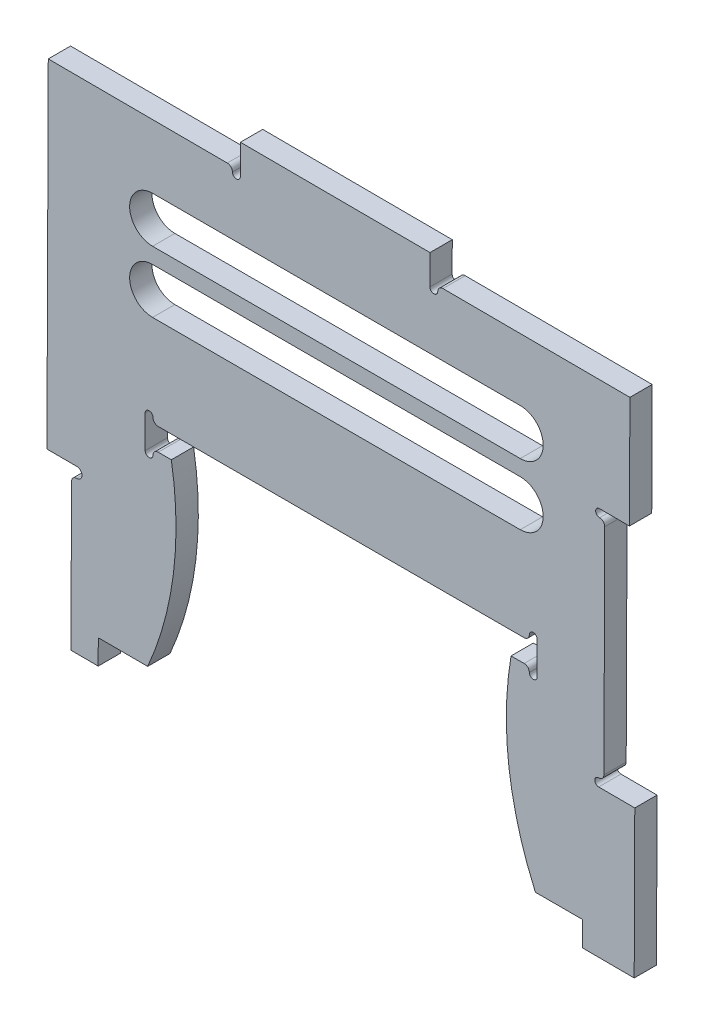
ISO-10303-21;
HEADER;
FILE_DESCRIPTION(('STEP AP214'),'2;1');
FILE_NAME('part.step','',(''),(''),'','','');
FILE_SCHEMA(('AUTOMOTIVE_DESIGN { 1 0 10303 214 1 1 1 1 }'));
ENDSEC;
DATA;
#1=APPLICATION_CONTEXT('core data for automotive mechanical design processes');
#2=APPLICATION_PROTOCOL_DEFINITION('international standard','automotive_design',2000,#1);
#3=PRODUCT_CONTEXT('',#1,'mechanical');
#4=PRODUCT('Part','Part','',(#3));
#5=PRODUCT_RELATED_PRODUCT_CATEGORY('part','',(#4));
#6=PRODUCT_DEFINITION_FORMATION('','',#4);
#7=PRODUCT_DEFINITION_CONTEXT('part definition',#1,'design');
#8=PRODUCT_DEFINITION('design','',#6,#7);
#9=PRODUCT_DEFINITION_SHAPE('','',#8);
#10=(LENGTH_UNIT() NAMED_UNIT(*) SI_UNIT(.MILLI.,.METRE.));
#11=(NAMED_UNIT(*) PLANE_ANGLE_UNIT() SI_UNIT($,.RADIAN.));
#12=(NAMED_UNIT(*) SI_UNIT($,.STERADIAN.) SOLID_ANGLE_UNIT());
#13=UNCERTAINTY_MEASURE_WITH_UNIT(LENGTH_MEASURE(1.E-05),#10,'distance_accuracy_value','');
#14=(GEOMETRIC_REPRESENTATION_CONTEXT(3) GLOBAL_UNCERTAINTY_ASSIGNED_CONTEXT((#13)) GLOBAL_UNIT_ASSIGNED_CONTEXT((#10,
#11,#12)) REPRESENTATION_CONTEXT('',''));
#15=CARTESIAN_POINT('',(0.,0.,0.));
#16=DIRECTION('',(0.,0.,1.));
#17=DIRECTION('',(1.,0.,0.));
#18=AXIS2_PLACEMENT_3D('',#15,#16,#17);
#19=CARTESIAN_POINT('',(82.2221803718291,172.147630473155,17.));
#20=DIRECTION('',(0.,0.,1.));
#21=DIRECTION('',(1.,0.,0.));
#22=AXIS2_PLACEMENT_3D('',#19,#20,#21);
#23=PLANE('',#22);
#24=CARTESIAN_POINT('',(82.2221803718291,172.147630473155,17.));
#25=DIRECTION('',(0.,0.,1.));
#26=DIRECTION('',(1.,0.,0.));
#27=AXIS2_PLACEMENT_3D('',#24,#25,#26);
#28=CIRCLE('',#27,3.95705263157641);
#29=CARTESIAN_POINT('',(82.2221803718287,176.104683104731,17.));
#30=VERTEX_POINT('',#29);
#31=CARTESIAN_POINT('',(78.2651277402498,172.147630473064,17.));
#32=VERTEX_POINT('',#31);
#33=EDGE_CURVE('E434',#30,#32,#28,.T.);
#34=ORIENTED_EDGE('',*,*,#33,.T.);
#35=CARTESIAN_POINT('',(75.2651277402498,172.147630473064,17.));
#36=DIRECTION('',(0.,0.,-1.));
#37=DIRECTION('',(1.,0.,0.));
#38=AXIS2_PLACEMENT_3D('',#35,#36,#37);
#39=CIRCLE('',#38,3.);
#40=CARTESIAN_POINT('',(72.2651277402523,172.147630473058,17.));
#41=VERTEX_POINT('',#40);
#42=EDGE_CURVE('E437',#32,#41,#39,.T.);
#43=ORIENTED_EDGE('',*,*,#42,.T.);
#44=DIRECTION('',(-1.55992139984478E-13,1.,0.));
#45=VECTOR('',#44,1.);
#46=CARTESIAN_POINT('',(72.2651277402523,172.147630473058,17.));
#47=LINE('',#46,#45);
#48=CARTESIAN_POINT('',(72.2651277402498,197.057735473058,17.));
#49=VERTEX_POINT('',#48);
#50=EDGE_CURVE('E440',#41,#49,#47,.T.);
#51=ORIENTED_EDGE('',*,*,#50,.T.);
#52=CARTESIAN_POINT('',(75.2651277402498,197.057735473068,17.));
#53=DIRECTION('',(0.,0.,-1.));
#54=DIRECTION('',(1.,0.,0.));
#55=AXIS2_PLACEMENT_3D('',#52,#53,#54);
#56=CIRCLE('',#55,3.00000000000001);
#57=CARTESIAN_POINT('',(78.2651277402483,197.057735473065,17.));
#58=VERTEX_POINT('',#57);
#59=EDGE_CURVE('E442',#49,#58,#56,.T.);
#60=ORIENTED_EDGE('',*,*,#59,.T.);
#61=CARTESIAN_POINT('',(82.2221803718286,197.057735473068,17.));
#62=DIRECTION('',(0.,0.,1.));
#63=DIRECTION('',(1.,0.,0.));
#64=AXIS2_PLACEMENT_3D('',#61,#62,#63);
#65=CIRCLE('',#64,3.95705263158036);
#66=CARTESIAN_POINT('',(82.2221803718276,193.100682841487,17.));
#67=VERTEX_POINT('',#66);
#68=EDGE_CURVE('E444',#58,#67,#65,.T.);
#69=ORIENTED_EDGE('',*,*,#68,.T.);
#70=DIRECTION('',(1.,0.,0.));
#71=VECTOR('',#70,1.);
#72=CARTESIAN_POINT('',(82.2221803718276,193.100682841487,17.));
#73=LINE('',#72,#71);
#74=CARTESIAN_POINT('',(361.293317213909,193.100682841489,17.));
#75=VERTEX_POINT('',#74);
#76=EDGE_CURVE('E446',#67,#75,#73,.T.);
#77=ORIENTED_EDGE('',*,*,#76,.T.);
#78=CARTESIAN_POINT('',(361.293317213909,197.057735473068,17.));
#79=DIRECTION('',(0.,0.,1.));
#80=DIRECTION('',(1.,0.,0.));
#81=AXIS2_PLACEMENT_3D('',#78,#79,#80);
#82=CIRCLE('',#81,3.95705263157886);
#83=CARTESIAN_POINT('',(365.250369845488,197.057735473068,17.));
#84=VERTEX_POINT('',#83);
#85=EDGE_CURVE('E448',#75,#84,#82,.T.);
#86=ORIENTED_EDGE('',*,*,#85,.T.);
#87=CARTESIAN_POINT('',(368.250369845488,197.057735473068,17.));
#88=DIRECTION('',(0.,0.,-1.));
#89=DIRECTION('',(1.,0.,0.));
#90=AXIS2_PLACEMENT_3D('',#87,#88,#89);
#91=CIRCLE('',#90,3.);
#92=CARTESIAN_POINT('',(371.250369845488,197.057735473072,17.));
#93=VERTEX_POINT('',#92);
#94=EDGE_CURVE('E450',#84,#93,#91,.T.);
#95=ORIENTED_EDGE('',*,*,#94,.T.);
#96=DIRECTION('',(0.,-1.,0.));
#97=VECTOR('',#96,1.);
#98=CARTESIAN_POINT('',(371.250369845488,197.057735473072,17.));
#99=LINE('',#98,#97);
#100=CARTESIAN_POINT('',(371.250369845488,172.147630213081,17.));
#101=VERTEX_POINT('',#100);
#102=EDGE_CURVE('E452',#93,#101,#99,.T.);
#103=ORIENTED_EDGE('',*,*,#102,.T.);
#104=CARTESIAN_POINT('',(368.250369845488,172.147630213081,17.));
#105=DIRECTION('',(0.,0.,-1.));
#106=DIRECTION('',(1.,0.,0.));
#107=AXIS2_PLACEMENT_3D('',#104,#105,#106);
#108=CIRCLE('',#107,3.);
#109=CARTESIAN_POINT('',(365.250369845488,172.147630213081,17.));
#110=VERTEX_POINT('',#109);
#111=EDGE_CURVE('E454',#101,#110,#108,.T.);
#112=ORIENTED_EDGE('',*,*,#111,.T.);
#113=CARTESIAN_POINT('',(361.293317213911,172.147630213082,17.));
#114=DIRECTION('',(0.,0.,1.));
#115=DIRECTION('',(1.,0.,0.));
#116=AXIS2_PLACEMENT_3D('',#113,#114,#115);
#117=CIRCLE('',#116,3.95705263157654);
#118=CARTESIAN_POINT('',(361.293317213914,176.104682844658,17.));
#119=VERTEX_POINT('',#118);
#120=EDGE_CURVE('E456',#110,#119,#117,.T.);
#121=ORIENTED_EDGE('',*,*,#120,.T.);
#122=DIRECTION('',(-1.,2.60073268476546E-08,0.));
#123=VECTOR('',#122,1.);
#124=CARTESIAN_POINT('',(361.293317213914,176.104682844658,17.));
#125=LINE('',#124,#123);
#126=CARTESIAN_POINT('',(351.293317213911,176.104683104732,17.));
#127=VERTEX_POINT('',#126);
#128=EDGE_CURVE('E458',#119,#127,#125,.T.);
#129=ORIENTED_EDGE('',*,*,#128,.T.);
#130=CARTESIAN_POINT('',(603.004593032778,133.44293493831,17.));
#131=DIRECTION('',(0.,0.,1.));
#132=DIRECTION('',(-1.,0.,0.));
#133=AXIS2_PLACEMENT_3D('',#130,#131,#132);
#134=CIRCLE('',#133,255.300981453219);
#135=CARTESIAN_POINT('',(369.339745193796,30.5870648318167,17.));
#136=VERTEX_POINT('',#135);
#137=EDGE_CURVE('E460',#127,#136,#134,.T.);
#138=ORIENTED_EDGE('',*,*,#137,.T.);
#139=CARTESIAN_POINT('',(370.730247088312,30.5758480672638,17.));
#140=DIRECTION('',(0.,0.,1.));
#141=DIRECTION('',(1.,0.,0.));
#142=AXIS2_PLACEMENT_3D('',#139,#140,#141);
#143=CIRCLE('',#142,1.39054713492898);
#144=CARTESIAN_POINT('',(370.210124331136,29.2862381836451,17.));
#145=VERTEX_POINT('',#144);
#146=EDGE_CURVE('E462',#136,#145,#143,.T.);
#147=ORIENTED_EDGE('',*,*,#146,.T.);
#148=DIRECTION('',(1.,0.,0.));
#149=VECTOR('',#148,1.);
#150=CARTESIAN_POINT('',(395.685128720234,29.2862381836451,17.));
#151=LINE('',#150,#149);
#152=CARTESIAN_POINT('',(405.64218135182,29.2862381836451,17.));
#153=VERTEX_POINT('',#152);
#154=EDGE_CURVE('E464',#145,#153,#151,.T.);
#155=ORIENTED_EDGE('',*,*,#154,.T.);
#156=DIRECTION('',(0.,-1.,0.));
#157=VECTOR('',#156,1.);
#158=CARTESIAN_POINT('',(405.64218135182,29.2862381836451,17.));
#159=LINE('',#158,#157);
#160=CARTESIAN_POINT('',(405.64218135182,10.4902381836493,17.));
#161=VERTEX_POINT('',#160);
#162=EDGE_CURVE('E466',#153,#161,#159,.T.);
#163=ORIENTED_EDGE('',*,*,#162,.T.);
#164=DIRECTION('',(0.999992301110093,-0.00392399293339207,0.));
#165=VECTOR('',#164,1.);
#166=CARTESIAN_POINT('',(405.64218135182,10.4902381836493,17.));
#167=LINE('',#166,#165);
#168=CARTESIAN_POINT('',(445.21240301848,10.3349637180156,17.));
#169=VERTEX_POINT('',#168);
#170=EDGE_CURVE('E468',#161,#169,#167,.T.);
#171=ORIENTED_EDGE('',*,*,#170,.T.);
#172=DIRECTION('',(0.00392399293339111,0.999992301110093,0.));
#173=VECTOR('',#172,1.);
#174=CARTESIAN_POINT('',(445.21240301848,10.3349637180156,17.));
#175=LINE('',#174,#173);
#176=CARTESIAN_POINT('',(445.653981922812,122.867150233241,17.));
#177=VERTEX_POINT('',#176);
#178=EDGE_CURVE('E470',#169,#177,#175,.T.);
#179=ORIENTED_EDGE('',*,*,#178,.T.);
#180=DIRECTION('',(-0.999992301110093,0.00392399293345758,0.));
#181=VECTOR('',#180,1.);
#182=CARTESIAN_POINT('',(445.653981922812,122.867150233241,17.));
#183=LINE('',#182,#181);
#184=CARTESIAN_POINT('',(418.115878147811,122.975210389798,17.));
#185=VERTEX_POINT('',#184);
#186=EDGE_CURVE('E472',#177,#185,#183,.T.);
#187=ORIENTED_EDGE('',*,*,#186,.T.);
#188=CARTESIAN_POINT('',(418.127650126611,125.975187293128,17.));
#189=DIRECTION('',(0.,0.,-1.));
#190=DIRECTION('',(1.,0.,0.));
#191=AXIS2_PLACEMENT_3D('',#188,#189,#190);
#192=CIRCLE('',#191,3.);
#193=CARTESIAN_POINT('',(418.139422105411,128.975164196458,17.));
#194=VERTEX_POINT('',#193);
#195=EDGE_CURVE('E474',#185,#194,#192,.T.);
#196=ORIENTED_EDGE('',*,*,#195,.T.);
#197=CARTESIAN_POINT('',(418.154949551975,132.932186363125,17.));
#198=DIRECTION('',(0.,0.,1.));
#199=DIRECTION('',(1.,0.,0.));
#200=AXIS2_PLACEMENT_3D('',#197,#198,#199);
#201=CIRCLE('',#200,3.95705263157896);
#202=CARTESIAN_POINT('',(422.111971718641,132.916658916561,17.));
#203=VERTEX_POINT('',#202);
#204=EDGE_CURVE('E476',#194,#203,#201,.T.);
#205=ORIENTED_EDGE('',*,*,#204,.T.);
#206=DIRECTION('',(0.00392399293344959,0.999992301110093,0.));
#207=VECTOR('',#206,1.);
#208=CARTESIAN_POINT('',(422.111971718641,132.916658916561,17.));
#209=LINE('',#208,#207);
#210=CARTESIAN_POINT('',(422.756360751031,297.133078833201,17.));
#211=VERTEX_POINT('',#210);
#212=EDGE_CURVE('E478',#203,#211,#209,.T.);
#213=ORIENTED_EDGE('',*,*,#212,.T.);
#214=CARTESIAN_POINT('',(418.799338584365,297.148606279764,17.));
#215=DIRECTION('',(0.,0.,1.));
#216=DIRECTION('',(1.,0.,0.));
#217=AXIS2_PLACEMENT_3D('',#214,#215,#216);
#218=CIRCLE('',#217,3.95705263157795);
#219=CARTESIAN_POINT('',(418.814866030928,301.10562844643,17.));
#220=VERTEX_POINT('',#219);
#221=EDGE_CURVE('E480',#211,#220,#218,.T.);
#222=ORIENTED_EDGE('',*,*,#221,.T.);
#223=CARTESIAN_POINT('',(418.826638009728,304.10560534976,17.));
#224=DIRECTION('',(0.,0.,-1.));
#225=DIRECTION('',(1.,0.,0.));
#226=AXIS2_PLACEMENT_3D('',#223,#224,#225);
#227=CIRCLE('',#226,2.99999999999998);
#228=CARTESIAN_POINT('',(418.838409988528,307.10558225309,17.));
#229=VERTEX_POINT('',#228);
#230=EDGE_CURVE('E482',#220,#229,#227,.T.);
#231=ORIENTED_EDGE('',*,*,#230,.T.);
#232=DIRECTION('',(0.999992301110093,-0.00392399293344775,0.));
#233=VECTOR('',#232,1.);
#234=CARTESIAN_POINT('',(418.838409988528,307.10558225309,17.));
#235=LINE('',#234,#233);
#236=CARTESIAN_POINT('',(441.591287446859,307.016299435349,17.));
#237=VERTEX_POINT('',#236);
#238=EDGE_CURVE('E484',#229,#237,#235,.T.);
#239=ORIENTED_EDGE('',*,*,#238,.T.);
#240=DIRECTION('',(0.00392399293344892,0.999992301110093,0.));
#241=VECTOR('',#240,1.);
#242=CARTESIAN_POINT('',(441.591287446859,307.016299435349,17.));
#243=LINE('',#242,#241);
#244=CARTESIAN_POINT('',(441.925516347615,392.191357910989,17.));
#245=VERTEX_POINT('',#244);
#246=EDGE_CURVE('E486',#237,#245,#243,.T.);
#247=ORIENTED_EDGE('',*,*,#246,.T.);
#248=DIRECTION('',(-0.999992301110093,0.00392399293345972,0.));
#249=VECTOR('',#248,1.);
#250=CARTESIAN_POINT('',(441.925516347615,392.191357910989,17.));
#251=LINE('',#250,#249);
#252=CARTESIAN_POINT('',(299.365259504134,392.750767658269,17.));
#253=VERTEX_POINT('',#252);
#254=EDGE_CURVE('E488',#245,#253,#251,.T.);
#255=ORIENTED_EDGE('',*,*,#254,.T.);
#256=CARTESIAN_POINT('',(299.349732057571,388.793745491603,17.));
#257=DIRECTION('',(0.,0.,1.));
#258=DIRECTION('',(1.,0.,0.));
#259=AXIS2_PLACEMENT_3D('',#256,#257,#258);
#260=CIRCLE('',#259,3.95705263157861);
#261=CARTESIAN_POINT('',(295.392709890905,388.809272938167,17.));
#262=VERTEX_POINT('',#261);
#263=EDGE_CURVE('E490',#253,#262,#260,.T.);
#264=ORIENTED_EDGE('',*,*,#263,.T.);
#265=CARTESIAN_POINT('',(292.392732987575,388.821044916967,17.));
#266=DIRECTION('',(0.,0.,-1.));
#267=DIRECTION('',(1.,0.,0.));
#268=AXIS2_PLACEMENT_3D('',#265,#266,#267);
#269=CIRCLE('',#268,2.99999999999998);
#270=CARTESIAN_POINT('',(289.392756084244,388.832816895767,17.));
#271=VERTEX_POINT('',#270);
#272=EDGE_CURVE('E492',#262,#271,#269,.T.);
#273=ORIENTED_EDGE('',*,*,#272,.T.);
#274=DIRECTION('',(0.00392399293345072,0.999992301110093,0.));
#275=VECTOR('',#274,1.);
#276=CARTESIAN_POINT('',(289.392756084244,388.832816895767,17.));
#277=LINE('',#276,#275);
#278=CARTESIAN_POINT('',(289.482038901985,411.585694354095,17.));
#279=VERTEX_POINT('',#278);
#280=EDGE_CURVE('E494',#271,#279,#277,.T.);
#281=ORIENTED_EDGE('',*,*,#280,.T.);
#282=DIRECTION('',(-0.999991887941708,0.00402790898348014,0.));
#283=VECTOR('',#282,1.);
#284=CARTESIAN_POINT('',(289.482038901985,411.585694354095,17.));
#285=LINE('',#284,#283);
#286=CARTESIAN_POINT('',(144.922038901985,412.16797360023,17.));
#287=VERTEX_POINT('',#286);
#288=EDGE_CURVE('E496',#279,#287,#285,.T.);
#289=ORIENTED_EDGE('',*,*,#288,.T.);
#290=DIRECTION('',(-0.00392399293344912,-0.999992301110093,0.));
#291=VECTOR('',#290,1.);
#292=CARTESIAN_POINT('',(144.922038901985,412.16797360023,17.));
#293=LINE('',#292,#291);
#294=CARTESIAN_POINT('',(144.832756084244,389.4150961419,17.));
#295=VERTEX_POINT('',#294);
#296=EDGE_CURVE('E498',#287,#295,#293,.T.);
#297=ORIENTED_EDGE('',*,*,#296,.T.);
#298=CARTESIAN_POINT('',(141.832779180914,389.426868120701,17.));
#299=DIRECTION('',(0.,0.,-1.));
#300=DIRECTION('',(1.,0.,0.));
#301=AXIS2_PLACEMENT_3D('',#298,#299,#300);
#302=CIRCLE('',#301,3.);
#303=CARTESIAN_POINT('',(138.832802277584,389.438640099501,17.));
#304=VERTEX_POINT('',#303);
#305=EDGE_CURVE('E500',#295,#304,#302,.T.);
#306=ORIENTED_EDGE('',*,*,#305,.T.);
#307=CARTESIAN_POINT('',(134.875780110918,389.454167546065,17.));
#308=DIRECTION('',(0.,0.,1.));
#309=DIRECTION('',(1.,0.,0.));
#310=AXIS2_PLACEMENT_3D('',#307,#308,#309);
#311=CIRCLE('',#310,3.95705263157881);
#312=CARTESIAN_POINT('',(134.891307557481,393.411189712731,17.));
#313=VERTEX_POINT('',#312);
#314=EDGE_CURVE('E502',#304,#313,#311,.T.);
#315=ORIENTED_EDGE('',*,*,#314,.T.);
#316=DIRECTION('',(-0.999992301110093,0.00392399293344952,0.));
#317=VECTOR('',#316,1.);
#318=CARTESIAN_POINT('',(134.891307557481,393.411189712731,17.));
#319=LINE('',#318,#317);
#320=CARTESIAN_POINT('',(-1.62595719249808,393.946886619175,17.));
#321=VERTEX_POINT('',#320);
#322=EDGE_CURVE('E504',#313,#321,#319,.T.);
#323=ORIENTED_EDGE('',*,*,#322,.T.);
#324=DIRECTION('',(-0.00392399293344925,-0.999992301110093,0.));
#325=VECTOR('',#324,1.);
#326=CARTESIAN_POINT('',(-1.62595719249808,393.946886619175,17.));
#327=LINE('',#326,#325);
#328=CARTESIAN_POINT('',(-2.63912308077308,135.751190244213,17.));
#329=VERTEX_POINT('',#328);
#330=EDGE_CURVE('E506',#321,#329,#327,.T.);
#331=ORIENTED_EDGE('',*,*,#330,.T.);
#332=DIRECTION('',(0.999992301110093,-0.00392399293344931,0.));
#333=VECTOR('',#332,1.);
#334=CARTESIAN_POINT('',(-2.63912308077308,135.751190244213,17.));
#335=LINE('',#334,#333);
#336=CARTESIAN_POINT('',(20.1137543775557,135.661907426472,17.));
#337=VERTEX_POINT('',#336);
#338=EDGE_CURVE('E508',#329,#337,#335,.T.);
#339=ORIENTED_EDGE('',*,*,#338,.T.);
#340=CARTESIAN_POINT('',(20.0982269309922,131.704885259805,17.));
#341=DIRECTION('',(0.,0.,-1.));
#342=DIRECTION('',(1.,0.,0.));
#343=AXIS2_PLACEMENT_3D('',#340,#341,#342);
#344=CIRCLE('',#343,3.95705263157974);
#345=CARTESIAN_POINT('',(20.0826994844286,127.747863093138,17.));
#346=VERTEX_POINT('',#345);
#347=EDGE_CURVE('E510',#337,#346,#344,.T.);
#348=ORIENTED_EDGE('',*,*,#347,.T.);
#349=CARTESIAN_POINT('',(20.067172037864,123.790840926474,17.));
#350=DIRECTION('',(0.,0.,1.));
#351=DIRECTION('',(1.,0.,0.));
#352=AXIS2_PLACEMENT_3D('',#349,#350,#351);
#353=CIRCLE('',#352,3.95705263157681);
#354=CARTESIAN_POINT('',(16.1101498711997,123.806368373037,17.));
#355=VERTEX_POINT('',#354);
#356=EDGE_CURVE('E512',#346,#355,#353,.T.);
#357=ORIENTED_EDGE('',*,*,#356,.T.);
#358=DIRECTION('',(-0.00392399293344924,-0.999992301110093,0.));
#359=VECTOR('',#358,1.);
#360=CARTESIAN_POINT('',(16.1101498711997,123.806368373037,17.));
#361=LINE('',#360,#359);
#362=CARTESIAN_POINT('',(15.671499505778,12.0204921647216,17.));
#363=VERTEX_POINT('',#362);
#364=EDGE_CURVE('E514',#355,#363,#361,.T.);
#365=ORIENTED_EDGE('',*,*,#364,.T.);
#366=DIRECTION('',(0.999992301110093,-0.00392399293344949,0.));
#367=VECTOR('',#366,1.);
#368=CARTESIAN_POINT('',(15.671499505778,12.0204921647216,17.));
#369=LINE('',#368,#367);
#370=CARTESIAN_POINT('',(36.4458658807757,11.9389730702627,17.));
#371=VERTEX_POINT('',#370);
#372=EDGE_CURVE('E516',#363,#371,#369,.T.);
#373=ORIENTED_EDGE('',*,*,#372,.T.);
#374=DIRECTION('',(0.00392399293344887,0.999992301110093,0.));
#375=VECTOR('',#374,1.);
#376=CARTESIAN_POINT('',(36.4458658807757,11.9389730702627,17.));
#377=LINE('',#376,#375);
#378=CARTESIAN_POINT('',(36.5196212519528,30.7348283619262,17.));
#379=VERTEX_POINT('',#378);
#380=EDGE_CURVE('E518',#371,#379,#377,.T.);
#381=ORIENTED_EDGE('',*,*,#380,.T.);
#382=DIRECTION('',(0.999992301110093,-0.0039239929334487,0.));
#383=VECTOR('',#382,1.);
#384=CARTESIAN_POINT('',(46.4765972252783,30.6957569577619,17.));
#385=LINE('',#384,#383);
#386=CARTESIAN_POINT('',(74.1757523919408,30.5870648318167,17.));
#387=VERTEX_POINT('',#386);
#388=EDGE_CURVE('E520',#379,#387,#385,.T.);
#389=ORIENTED_EDGE('',*,*,#388,.T.);
#390=CARTESIAN_POINT('',(-159.489095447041,133.44293493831,17.));
#391=DIRECTION('',(0.,0.,1.));
#392=DIRECTION('',(1.,0.,0.));
#393=AXIS2_PLACEMENT_3D('',#390,#391,#392);
#394=CIRCLE('',#393,255.300981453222);
#395=CARTESIAN_POINT('',(92.2221803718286,176.104683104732,17.));
#396=VERTEX_POINT('',#395);
#397=EDGE_CURVE('E522',#387,#396,#394,.T.);
#398=ORIENTED_EDGE('',*,*,#397,.T.);
#399=DIRECTION('',(-1.,0.,0.));
#400=VECTOR('',#399,1.);
#401=CARTESIAN_POINT('',(92.2221803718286,176.104683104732,17.));
#402=LINE('',#401,#400);
#403=EDGE_CURVE('E524',#396,#30,#402,.T.);
#404=ORIENTED_EDGE('',*,*,#403,.T.);
#405=EDGE_LOOP('',(#34,#43,#51,#60,#69,#77,#86,#95,#103,#112,#121,#129,#138,#147,#155,#163,#171,
#179,#187,#196,#205,#213,#222,#231,#239,#247,#255,#264,#273,#281,#289,#297,#306,#315,#323,#331,
#339,#348,#357,#365,#373,#381,#389,#398,#404));
#406=FACE_BOUND('',#405,.T.);
#407=DIRECTION('',(1.,0.,0.));
#408=VECTOR('',#407,1.);
#409=CARTESIAN_POINT('',(77.9293251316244,309.957853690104,17.));
#410=LINE('',#409,#408);
#411=CARTESIAN_POINT('',(77.9293251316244,309.957853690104,17.));
#412=VERTEX_POINT('',#411);
#413=CARTESIAN_POINT('',(358.300339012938,309.957853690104,17.));
#414=VERTEX_POINT('',#413);
#415=EDGE_CURVE('E405',#412,#414,#410,.T.);
#416=ORIENTED_EDGE('',*,*,#415,.F.);
#417=CARTESIAN_POINT('',(77.9293251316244,327.457853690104,17.));
#418=DIRECTION('',(0.,0.,1.));
#419=DIRECTION('',(1.,0.,0.));
#420=AXIS2_PLACEMENT_3D('',#417,#418,#419);
#421=CIRCLE('',#420,17.5);
#422=CARTESIAN_POINT('',(77.9293251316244,344.957853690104,17.));
#423=VERTEX_POINT('',#422);
#424=EDGE_CURVE('E403',#423,#412,#421,.T.);
#425=ORIENTED_EDGE('',*,*,#424,.F.);
#426=DIRECTION('',(-1.,0.,0.));
#427=VECTOR('',#426,1.);
#428=CARTESIAN_POINT('',(77.9293251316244,344.957853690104,17.));
#429=LINE('',#428,#427);
#430=CARTESIAN_POINT('',(358.300339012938,344.957853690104,17.));
#431=VERTEX_POINT('',#430);
#432=EDGE_CURVE('E411',#431,#423,#429,.T.);
#433=ORIENTED_EDGE('',*,*,#432,.F.);
#434=CARTESIAN_POINT('',(358.300339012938,327.457853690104,17.));
#435=DIRECTION('',(0.,0.,1.));
#436=DIRECTION('',(1.,0.,0.));
#437=AXIS2_PLACEMENT_3D('',#434,#435,#436);
#438=CIRCLE('',#437,17.5);
#439=EDGE_CURVE('E408',#414,#431,#438,.T.);
#440=ORIENTED_EDGE('',*,*,#439,.F.);
#441=EDGE_LOOP('',(#416,#425,#433,#440));
#442=FACE_BOUND('',#441,.T.);
#443=DIRECTION('',(1.,0.,0.));
#444=VECTOR('',#443,1.);
#445=CARTESIAN_POINT('',(77.9293251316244,262.957853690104,17.));
#446=LINE('',#445,#444);
#447=CARTESIAN_POINT('',(77.9293251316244,262.957853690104,17.));
#448=VERTEX_POINT('',#447);
#449=CARTESIAN_POINT('',(358.300339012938,262.957853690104,17.));
#450=VERTEX_POINT('',#449);
#451=EDGE_CURVE('E375',#448,#450,#446,.T.);
#452=ORIENTED_EDGE('',*,*,#451,.F.);
#453=CARTESIAN_POINT('',(77.9293251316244,280.457853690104,17.));
#454=DIRECTION('',(0.,0.,1.));
#455=DIRECTION('',(-1.,0.,0.));
#456=AXIS2_PLACEMENT_3D('',#453,#454,#455);
#457=CIRCLE('',#456,17.5);
#458=CARTESIAN_POINT('',(77.9293251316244,297.957853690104,17.));
#459=VERTEX_POINT('',#458);
#460=EDGE_CURVE('E367',#459,#448,#457,.T.);
#461=ORIENTED_EDGE('',*,*,#460,.F.);
#462=DIRECTION('',(-1.,0.,0.));
#463=VECTOR('',#462,1.);
#464=CARTESIAN_POINT('',(77.9293251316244,297.957853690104,17.));
#465=LINE('',#464,#463);
#466=CARTESIAN_POINT('',(358.300339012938,297.957853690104,17.));
#467=VERTEX_POINT('',#466);
#468=EDGE_CURVE('E389',#467,#459,#465,.T.);
#469=ORIENTED_EDGE('',*,*,#468,.F.);
#470=CARTESIAN_POINT('',(358.300339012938,280.457853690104,17.));
#471=DIRECTION('',(0.,0.,1.));
#472=DIRECTION('',(-1.,0.,0.));
#473=AXIS2_PLACEMENT_3D('',#470,#471,#472);
#474=CIRCLE('',#473,17.5);
#475=EDGE_CURVE('E387',#450,#467,#474,.T.);
#476=ORIENTED_EDGE('',*,*,#475,.F.);
#477=EDGE_LOOP('',(#452,#461,#469,#476));
#478=FACE_BOUND('',#477,.T.);
#479=ADVANCED_FACE('F32',(#406,#442,#478),#23,.T.);
#480=CARTESIAN_POINT('',(82.2221803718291,172.147630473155,0.));
#481=DIRECTION('',(0.,0.,1.));
#482=DIRECTION('',(1.,0.,0.));
#483=AXIS2_PLACEMENT_3D('',#480,#481,#482);
#484=PLANE('',#483);
#485=CARTESIAN_POINT('',(77.9293251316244,327.457853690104,0.));
#486=DIRECTION('',(0.,0.,1.));
#487=DIRECTION('',(1.,0.,0.));
#488=AXIS2_PLACEMENT_3D('',#485,#486,#487);
#489=CIRCLE('',#488,17.5);
#490=CARTESIAN_POINT('',(77.9293251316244,344.957853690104,0.));
#491=VERTEX_POINT('',#490);
#492=CARTESIAN_POINT('',(77.9293251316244,309.957853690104,0.));
#493=VERTEX_POINT('',#492);
#494=EDGE_CURVE('E383',#491,#493,#489,.T.);
#495=ORIENTED_EDGE('',*,*,#494,.T.);
#496=DIRECTION('',(1.,0.,0.));
#497=VECTOR('',#496,1.);
#498=CARTESIAN_POINT('',(77.9293251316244,309.957853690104,0.));
#499=LINE('',#498,#497);
#500=CARTESIAN_POINT('',(358.300339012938,309.957853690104,0.));
#501=VERTEX_POINT('',#500);
#502=EDGE_CURVE('E416',#493,#501,#499,.T.);
#503=ORIENTED_EDGE('',*,*,#502,.T.);
#504=CARTESIAN_POINT('',(358.300339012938,327.457853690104,0.));
#505=DIRECTION('',(0.,0.,1.));
#506=DIRECTION('',(1.,0.,0.));
#507=AXIS2_PLACEMENT_3D('',#504,#505,#506);
#508=CIRCLE('',#507,17.5);
#509=CARTESIAN_POINT('',(358.300339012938,344.957853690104,0.));
#510=VERTEX_POINT('',#509);
#511=EDGE_CURVE('E419',#501,#510,#508,.T.);
#512=ORIENTED_EDGE('',*,*,#511,.T.);
#513=DIRECTION('',(-1.,0.,0.));
#514=VECTOR('',#513,1.);
#515=CARTESIAN_POINT('',(77.9293251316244,344.957853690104,0.));
#516=LINE('',#515,#514);
#517=EDGE_CURVE('E406',#510,#491,#516,.T.);
#518=ORIENTED_EDGE('',*,*,#517,.T.);
#519=EDGE_LOOP('',(#495,#503,#512,#518));
#520=FACE_BOUND('',#519,.T.);
#521=CARTESIAN_POINT('',(82.2221803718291,172.147630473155,0.));
#522=DIRECTION('',(0.,0.,1.));
#523=DIRECTION('',(1.,0.,0.));
#524=AXIS2_PLACEMENT_3D('',#521,#522,#523);
#525=CIRCLE('',#524,3.95705263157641);
#526=CARTESIAN_POINT('',(82.2221803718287,176.104683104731,0.));
#527=VERTEX_POINT('',#526);
#528=CARTESIAN_POINT('',(78.2651277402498,172.147630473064,0.));
#529=VERTEX_POINT('',#528);
#530=EDGE_CURVE('E433',#527,#529,#525,.T.);
#531=ORIENTED_EDGE('',*,*,#530,.F.);
#532=DIRECTION('',(-1.,0.,0.));
#533=VECTOR('',#532,1.);
#534=CARTESIAN_POINT('',(92.2221803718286,176.104683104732,0.));
#535=LINE('',#534,#533);
#536=CARTESIAN_POINT('',(92.2221803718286,176.104683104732,0.));
#537=VERTEX_POINT('',#536);
#538=EDGE_CURVE('E438',#537,#527,#535,.T.);
#539=ORIENTED_EDGE('',*,*,#538,.F.);
#540=CARTESIAN_POINT('',(-159.489095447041,133.44293493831,0.));
#541=DIRECTION('',(0.,0.,1.));
#542=DIRECTION('',(1.,0.,0.));
#543=AXIS2_PLACEMENT_3D('',#540,#541,#542);
#544=CIRCLE('',#543,255.300981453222);
#545=CARTESIAN_POINT('',(74.1757523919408,30.5870648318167,0.));
#546=VERTEX_POINT('',#545);
#547=EDGE_CURVE('E615',#546,#537,#544,.T.);
#548=ORIENTED_EDGE('',*,*,#547,.F.);
#549=DIRECTION('',(0.999992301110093,-0.00392399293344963,0.));
#550=VECTOR('',#549,1.);
#551=CARTESIAN_POINT('',(46.4765972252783,30.6957569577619,0.));
#552=LINE('',#551,#550);
#553=CARTESIAN_POINT('',(36.5196212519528,30.7348283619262,0.));
#554=VERTEX_POINT('',#553);
#555=EDGE_CURVE('E613',#554,#546,#552,.T.);
#556=ORIENTED_EDGE('',*,*,#555,.F.);
#557=DIRECTION('',(0.00392399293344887,0.999992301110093,0.));
#558=VECTOR('',#557,1.);
#559=CARTESIAN_POINT('',(36.4458658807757,11.9389730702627,0.));
#560=LINE('',#559,#558);
#561=CARTESIAN_POINT('',(36.4458658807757,11.9389730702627,0.));
#562=VERTEX_POINT('',#561);
#563=EDGE_CURVE('E610',#562,#554,#560,.T.);
#564=ORIENTED_EDGE('',*,*,#563,.F.);
#565=DIRECTION('',(0.999992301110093,-0.00392399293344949,0.));
#566=VECTOR('',#565,1.);
#567=CARTESIAN_POINT('',(15.671499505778,12.0204921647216,0.));
#568=LINE('',#567,#566);
#569=CARTESIAN_POINT('',(15.671499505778,12.0204921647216,0.));
#570=VERTEX_POINT('',#569);
#571=EDGE_CURVE('E608',#570,#562,#568,.T.);
#572=ORIENTED_EDGE('',*,*,#571,.F.);
#573=DIRECTION('',(-0.00392399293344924,-0.999992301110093,0.));
#574=VECTOR('',#573,1.);
#575=CARTESIAN_POINT('',(16.1101498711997,123.806368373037,0.));
#576=LINE('',#575,#574);
#577=CARTESIAN_POINT('',(16.1101498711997,123.806368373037,0.));
#578=VERTEX_POINT('',#577);
#579=EDGE_CURVE('E606',#578,#570,#576,.T.);
#580=ORIENTED_EDGE('',*,*,#579,.F.);
#581=CARTESIAN_POINT('',(20.067172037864,123.790840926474,0.));
#582=DIRECTION('',(0.,0.,1.));
#583=DIRECTION('',(1.,0.,0.));
#584=AXIS2_PLACEMENT_3D('',#581,#582,#583);
#585=CIRCLE('',#584,3.95705263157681);
#586=CARTESIAN_POINT('',(20.0826994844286,127.747863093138,0.));
#587=VERTEX_POINT('',#586);
#588=EDGE_CURVE('E604',#587,#578,#585,.T.);
#589=ORIENTED_EDGE('',*,*,#588,.F.);
#590=CARTESIAN_POINT('',(20.0982269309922,131.704885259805,0.));
#591=DIRECTION('',(0.,0.,-1.));
#592=DIRECTION('',(1.,0.,0.));
#593=AXIS2_PLACEMENT_3D('',#590,#591,#592);
#594=CIRCLE('',#593,3.95705263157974);
#595=CARTESIAN_POINT('',(20.1137543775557,135.661907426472,0.));
#596=VERTEX_POINT('',#595);
#597=EDGE_CURVE('E602',#596,#587,#594,.T.);
#598=ORIENTED_EDGE('',*,*,#597,.F.);
#599=DIRECTION('',(0.999992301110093,-0.00392399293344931,0.));
#600=VECTOR('',#599,1.);
#601=CARTESIAN_POINT('',(-2.63912308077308,135.751190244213,0.));
#602=LINE('',#601,#600);
#603=CARTESIAN_POINT('',(-2.63912308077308,135.751190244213,0.));
#604=VERTEX_POINT('',#603);
#605=EDGE_CURVE('E600',#604,#596,#602,.T.);
#606=ORIENTED_EDGE('',*,*,#605,.F.);
#607=DIRECTION('',(-0.00392399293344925,-0.999992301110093,0.));
#608=VECTOR('',#607,1.);
#609=CARTESIAN_POINT('',(-1.62595719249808,393.946886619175,0.));
#610=LINE('',#609,#608);
#611=CARTESIAN_POINT('',(-1.62595719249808,393.946886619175,0.));
#612=VERTEX_POINT('',#611);
#613=EDGE_CURVE('E598',#612,#604,#610,.T.);
#614=ORIENTED_EDGE('',*,*,#613,.F.);
#615=DIRECTION('',(-0.999992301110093,0.00392399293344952,0.));
#616=VECTOR('',#615,1.);
#617=CARTESIAN_POINT('',(134.891307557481,393.411189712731,0.));
#618=LINE('',#617,#616);
#619=CARTESIAN_POINT('',(134.891307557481,393.411189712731,0.));
#620=VERTEX_POINT('',#619);
#621=EDGE_CURVE('E596',#620,#612,#618,.T.);
#622=ORIENTED_EDGE('',*,*,#621,.F.);
#623=CARTESIAN_POINT('',(134.875780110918,389.454167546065,0.));
#624=DIRECTION('',(0.,0.,1.));
#625=DIRECTION('',(1.,0.,0.));
#626=AXIS2_PLACEMENT_3D('',#623,#624,#625);
#627=CIRCLE('',#626,3.95705263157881);
#628=CARTESIAN_POINT('',(138.832802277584,389.438640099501,0.));
#629=VERTEX_POINT('',#628);
#630=EDGE_CURVE('E594',#629,#620,#627,.T.);
#631=ORIENTED_EDGE('',*,*,#630,.F.);
#632=CARTESIAN_POINT('',(141.832779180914,389.426868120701,0.));
#633=DIRECTION('',(0.,0.,-1.));
#634=DIRECTION('',(1.,0.,0.));
#635=AXIS2_PLACEMENT_3D('',#632,#633,#634);
#636=CIRCLE('',#635,3.);
#637=CARTESIAN_POINT('',(144.832756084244,389.4150961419,0.));
#638=VERTEX_POINT('',#637);
#639=EDGE_CURVE('E592',#638,#629,#636,.T.);
#640=ORIENTED_EDGE('',*,*,#639,.F.);
#641=DIRECTION('',(-0.00392399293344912,-0.999992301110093,0.));
#642=VECTOR('',#641,1.);
#643=CARTESIAN_POINT('',(144.922038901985,412.16797360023,0.));
#644=LINE('',#643,#642);
#645=CARTESIAN_POINT('',(144.922038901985,412.16797360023,0.));
#646=VERTEX_POINT('',#645);
#647=EDGE_CURVE('E590',#646,#638,#644,.T.);
#648=ORIENTED_EDGE('',*,*,#647,.F.);
#649=DIRECTION('',(-0.999991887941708,0.00402790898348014,0.));
#650=VECTOR('',#649,1.);
#651=CARTESIAN_POINT('',(289.482038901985,411.585694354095,0.));
#652=LINE('',#651,#650);
#653=CARTESIAN_POINT('',(289.482038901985,411.585694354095,0.));
#654=VERTEX_POINT('',#653);
#655=EDGE_CURVE('E588',#654,#646,#652,.T.);
#656=ORIENTED_EDGE('',*,*,#655,.F.);
#657=DIRECTION('',(0.00392399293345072,0.999992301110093,0.));
#658=VECTOR('',#657,1.);
#659=CARTESIAN_POINT('',(289.392756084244,388.832816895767,0.));
#660=LINE('',#659,#658);
#661=CARTESIAN_POINT('',(289.392756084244,388.832816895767,0.));
#662=VERTEX_POINT('',#661);
#663=EDGE_CURVE('E586',#662,#654,#660,.T.);
#664=ORIENTED_EDGE('',*,*,#663,.F.);
#665=CARTESIAN_POINT('',(292.392732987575,388.821044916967,0.));
#666=DIRECTION('',(0.,0.,-1.));
#667=DIRECTION('',(1.,0.,0.));
#668=AXIS2_PLACEMENT_3D('',#665,#666,#667);
#669=CIRCLE('',#668,2.99999999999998);
#670=CARTESIAN_POINT('',(295.392709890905,388.809272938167,0.));
#671=VERTEX_POINT('',#670);
#672=EDGE_CURVE('E584',#671,#662,#669,.T.);
#673=ORIENTED_EDGE('',*,*,#672,.F.);
#674=CARTESIAN_POINT('',(299.349732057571,388.793745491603,0.));
#675=DIRECTION('',(0.,0.,1.));
#676=DIRECTION('',(1.,0.,0.));
#677=AXIS2_PLACEMENT_3D('',#674,#675,#676);
#678=CIRCLE('',#677,3.95705263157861);
#679=CARTESIAN_POINT('',(299.365259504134,392.750767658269,0.));
#680=VERTEX_POINT('',#679);
#681=EDGE_CURVE('E582',#680,#671,#678,.T.);
#682=ORIENTED_EDGE('',*,*,#681,.F.);
#683=DIRECTION('',(-0.999992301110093,0.00392399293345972,0.));
#684=VECTOR('',#683,1.);
#685=CARTESIAN_POINT('',(441.925516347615,392.191357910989,0.));
#686=LINE('',#685,#684);
#687=CARTESIAN_POINT('',(441.925516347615,392.191357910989,0.));
#688=VERTEX_POINT('',#687);
#689=EDGE_CURVE('E580',#688,#680,#686,.T.);
#690=ORIENTED_EDGE('',*,*,#689,.F.);
#691=DIRECTION('',(0.00392399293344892,0.999992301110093,0.));
#692=VECTOR('',#691,1.);
#693=CARTESIAN_POINT('',(441.591287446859,307.016299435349,0.));
#694=LINE('',#693,#692);
#695=CARTESIAN_POINT('',(441.591287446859,307.016299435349,0.));
#696=VERTEX_POINT('',#695);
#697=EDGE_CURVE('E578',#696,#688,#694,.T.);
#698=ORIENTED_EDGE('',*,*,#697,.F.);
#699=DIRECTION('',(0.999992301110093,-0.00392399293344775,0.));
#700=VECTOR('',#699,1.);
#701=CARTESIAN_POINT('',(418.838409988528,307.10558225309,0.));
#702=LINE('',#701,#700);
#703=CARTESIAN_POINT('',(418.838409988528,307.10558225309,0.));
#704=VERTEX_POINT('',#703);
#705=EDGE_CURVE('E576',#704,#696,#702,.T.);
#706=ORIENTED_EDGE('',*,*,#705,.F.);
#707=CARTESIAN_POINT('',(418.826638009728,304.10560534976,0.));
#708=DIRECTION('',(0.,0.,-1.));
#709=DIRECTION('',(1.,0.,0.));
#710=AXIS2_PLACEMENT_3D('',#707,#708,#709);
#711=CIRCLE('',#710,2.99999999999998);
#712=CARTESIAN_POINT('',(418.814866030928,301.10562844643,0.));
#713=VERTEX_POINT('',#712);
#714=EDGE_CURVE('E574',#713,#704,#711,.T.);
#715=ORIENTED_EDGE('',*,*,#714,.F.);
#716=CARTESIAN_POINT('',(418.799338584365,297.148606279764,0.));
#717=DIRECTION('',(0.,0.,1.));
#718=DIRECTION('',(1.,0.,0.));
#719=AXIS2_PLACEMENT_3D('',#716,#717,#718);
#720=CIRCLE('',#719,3.95705263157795);
#721=CARTESIAN_POINT('',(422.756360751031,297.133078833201,0.));
#722=VERTEX_POINT('',#721);
#723=EDGE_CURVE('E572',#722,#713,#720,.T.);
#724=ORIENTED_EDGE('',*,*,#723,.F.);
#725=DIRECTION('',(0.00392399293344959,0.999992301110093,0.));
#726=VECTOR('',#725,1.);
#727=CARTESIAN_POINT('',(422.111971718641,132.916658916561,0.));
#728=LINE('',#727,#726);
#729=CARTESIAN_POINT('',(422.111971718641,132.916658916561,0.));
#730=VERTEX_POINT('',#729);
#731=EDGE_CURVE('E570',#730,#722,#728,.T.);
#732=ORIENTED_EDGE('',*,*,#731,.F.);
#733=CARTESIAN_POINT('',(418.154949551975,132.932186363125,0.));
#734=DIRECTION('',(0.,0.,1.));
#735=DIRECTION('',(1.,0.,0.));
#736=AXIS2_PLACEMENT_3D('',#733,#734,#735);
#737=CIRCLE('',#736,3.95705263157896);
#738=CARTESIAN_POINT('',(418.139422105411,128.975164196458,0.));
#739=VERTEX_POINT('',#738);
#740=EDGE_CURVE('E568',#739,#730,#737,.T.);
#741=ORIENTED_EDGE('',*,*,#740,.F.);
#742=CARTESIAN_POINT('',(418.127650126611,125.975187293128,0.));
#743=DIRECTION('',(0.,0.,-1.));
#744=DIRECTION('',(1.,0.,0.));
#745=AXIS2_PLACEMENT_3D('',#742,#743,#744);
#746=CIRCLE('',#745,3.);
#747=CARTESIAN_POINT('',(418.115878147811,122.975210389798,0.));
#748=VERTEX_POINT('',#747);
#749=EDGE_CURVE('E566',#748,#739,#746,.T.);
#750=ORIENTED_EDGE('',*,*,#749,.F.);
#751=DIRECTION('',(-0.999992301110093,0.00392399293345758,0.));
#752=VECTOR('',#751,1.);
#753=CARTESIAN_POINT('',(445.653981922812,122.867150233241,0.));
#754=LINE('',#753,#752);
#755=CARTESIAN_POINT('',(445.653981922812,122.867150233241,0.));
#756=VERTEX_POINT('',#755);
#757=EDGE_CURVE('E564',#756,#748,#754,.T.);
#758=ORIENTED_EDGE('',*,*,#757,.F.);
#759=DIRECTION('',(0.00392399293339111,0.999992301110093,0.));
#760=VECTOR('',#759,1.);
#761=CARTESIAN_POINT('',(445.21240301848,10.3349637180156,0.));
#762=LINE('',#761,#760);
#763=CARTESIAN_POINT('',(445.21240301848,10.3349637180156,0.));
#764=VERTEX_POINT('',#763);
#765=EDGE_CURVE('E562',#764,#756,#762,.T.);
#766=ORIENTED_EDGE('',*,*,#765,.F.);
#767=DIRECTION('',(0.999992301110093,-0.00392399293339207,0.));
#768=VECTOR('',#767,1.);
#769=CARTESIAN_POINT('',(405.64218135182,10.4902381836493,0.));
#770=LINE('',#769,#768);
#771=CARTESIAN_POINT('',(405.64218135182,10.4902381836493,0.));
#772=VERTEX_POINT('',#771);
#773=EDGE_CURVE('E560',#772,#764,#770,.T.);
#774=ORIENTED_EDGE('',*,*,#773,.F.);
#775=DIRECTION('',(0.,-1.,0.));
#776=VECTOR('',#775,1.);
#777=CARTESIAN_POINT('',(405.64218135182,29.2862381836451,0.));
#778=LINE('',#777,#776);
#779=CARTESIAN_POINT('',(405.64218135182,29.2862381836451,0.));
#780=VERTEX_POINT('',#779);
#781=EDGE_CURVE('E558',#780,#772,#778,.T.);
#782=ORIENTED_EDGE('',*,*,#781,.F.);
#783=DIRECTION('',(1.,0.,0.));
#784=VECTOR('',#783,1.);
#785=CARTESIAN_POINT('',(395.685128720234,29.2862381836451,0.));
#786=LINE('',#785,#784);
#787=CARTESIAN_POINT('',(370.210124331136,29.2862381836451,0.));
#788=VERTEX_POINT('',#787);
#789=EDGE_CURVE('E556',#788,#780,#786,.T.);
#790=ORIENTED_EDGE('',*,*,#789,.F.);
#791=CARTESIAN_POINT('',(370.730247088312,30.5758480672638,0.));
#792=DIRECTION('',(0.,0.,1.));
#793=DIRECTION('',(1.,0.,0.));
#794=AXIS2_PLACEMENT_3D('',#791,#792,#793);
#795=CIRCLE('',#794,1.39054713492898);
#796=CARTESIAN_POINT('',(369.339745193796,30.5870648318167,0.));
#797=VERTEX_POINT('',#796);
#798=EDGE_CURVE('E553',#797,#788,#795,.T.);
#799=ORIENTED_EDGE('',*,*,#798,.F.);
#800=CARTESIAN_POINT('',(603.004593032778,133.44293493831,0.));
#801=DIRECTION('',(0.,0.,1.));
#802=DIRECTION('',(-1.,0.,0.));
#803=AXIS2_PLACEMENT_3D('',#800,#801,#802);
#804=CIRCLE('',#803,255.300981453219);
#805=CARTESIAN_POINT('',(351.293317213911,176.104683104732,0.));
#806=VERTEX_POINT('',#805);
#807=EDGE_CURVE('E551',#806,#797,#804,.T.);
#808=ORIENTED_EDGE('',*,*,#807,.F.);
#809=DIRECTION('',(-1.,2.60073268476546E-08,0.));
#810=VECTOR('',#809,1.);
#811=CARTESIAN_POINT('',(361.293317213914,176.104682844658,0.));
#812=LINE('',#811,#810);
#813=CARTESIAN_POINT('',(361.293317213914,176.104682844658,0.));
#814=VERTEX_POINT('',#813);
#815=EDGE_CURVE('E549',#814,#806,#812,.T.);
#816=ORIENTED_EDGE('',*,*,#815,.F.);
#817=CARTESIAN_POINT('',(361.293317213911,172.147630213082,0.));
#818=DIRECTION('',(0.,0.,1.));
#819=DIRECTION('',(1.,0.,0.));
#820=AXIS2_PLACEMENT_3D('',#817,#818,#819);
#821=CIRCLE('',#820,3.95705263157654);
#822=CARTESIAN_POINT('',(365.250369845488,172.147630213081,0.));
#823=VERTEX_POINT('',#822);
#824=EDGE_CURVE('E547',#823,#814,#821,.T.);
#825=ORIENTED_EDGE('',*,*,#824,.F.);
#826=CARTESIAN_POINT('',(368.250369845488,172.147630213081,0.));
#827=DIRECTION('',(0.,0.,-1.));
#828=DIRECTION('',(1.,0.,0.));
#829=AXIS2_PLACEMENT_3D('',#826,#827,#828);
#830=CIRCLE('',#829,3.);
#831=CARTESIAN_POINT('',(371.250369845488,172.147630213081,0.));
#832=VERTEX_POINT('',#831);
#833=EDGE_CURVE('E545',#832,#823,#830,.T.);
#834=ORIENTED_EDGE('',*,*,#833,.F.);
#835=DIRECTION('',(0.,-1.,0.));
#836=VECTOR('',#835,1.);
#837=CARTESIAN_POINT('',(371.250369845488,197.057735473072,0.));
#838=LINE('',#837,#836);
#839=CARTESIAN_POINT('',(371.250369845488,197.057735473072,0.));
#840=VERTEX_POINT('',#839);
#841=EDGE_CURVE('E543',#840,#832,#838,.T.);
#842=ORIENTED_EDGE('',*,*,#841,.F.);
#843=CARTESIAN_POINT('',(368.250369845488,197.057735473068,0.));
#844=DIRECTION('',(0.,0.,-1.));
#845=DIRECTION('',(1.,0.,0.));
#846=AXIS2_PLACEMENT_3D('',#843,#844,#845);
#847=CIRCLE('',#846,3.);
#848=CARTESIAN_POINT('',(365.250369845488,197.057735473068,0.));
#849=VERTEX_POINT('',#848);
#850=EDGE_CURVE('E541',#849,#840,#847,.T.);
#851=ORIENTED_EDGE('',*,*,#850,.F.);
#852=CARTESIAN_POINT('',(361.293317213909,197.057735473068,0.));
#853=DIRECTION('',(0.,0.,1.));
#854=DIRECTION('',(1.,0.,0.));
#855=AXIS2_PLACEMENT_3D('',#852,#853,#854);
#856=CIRCLE('',#855,3.95705263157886);
#857=CARTESIAN_POINT('',(361.293317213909,193.100682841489,0.));
#858=VERTEX_POINT('',#857);
#859=EDGE_CURVE('E539',#858,#849,#856,.T.);
#860=ORIENTED_EDGE('',*,*,#859,.F.);
#861=DIRECTION('',(1.,0.,0.));
#862=VECTOR('',#861,1.);
#863=CARTESIAN_POINT('',(82.2221803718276,193.100682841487,0.));
#864=LINE('',#863,#862);
#865=CARTESIAN_POINT('',(82.2221803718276,193.100682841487,0.));
#866=VERTEX_POINT('',#865);
#867=EDGE_CURVE('E537',#866,#858,#864,.T.);
#868=ORIENTED_EDGE('',*,*,#867,.F.);
#869=CARTESIAN_POINT('',(82.2221803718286,197.057735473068,0.));
#870=DIRECTION('',(0.,0.,1.));
#871=DIRECTION('',(1.,0.,0.));
#872=AXIS2_PLACEMENT_3D('',#869,#870,#871);
#873=CIRCLE('',#872,3.95705263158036);
#874=CARTESIAN_POINT('',(78.2651277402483,197.057735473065,0.));
#875=VERTEX_POINT('',#874);
#876=EDGE_CURVE('E535',#875,#866,#873,.T.);
#877=ORIENTED_EDGE('',*,*,#876,.F.);
#878=CARTESIAN_POINT('',(75.2651277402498,197.057735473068,0.));
#879=DIRECTION('',(0.,0.,-1.));
#880=DIRECTION('',(1.,0.,0.));
#881=AXIS2_PLACEMENT_3D('',#878,#879,#880);
#882=CIRCLE('',#881,3.00000000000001);
#883=CARTESIAN_POINT('',(72.2651277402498,197.057735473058,0.));
#884=VERTEX_POINT('',#883);
#885=EDGE_CURVE('E533',#884,#875,#882,.T.);
#886=ORIENTED_EDGE('',*,*,#885,.F.);
#887=DIRECTION('',(-1.55992139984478E-13,1.,0.));
#888=VECTOR('',#887,1.);
#889=CARTESIAN_POINT('',(72.2651277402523,172.147630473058,0.));
#890=LINE('',#889,#888);
#891=CARTESIAN_POINT('',(72.2651277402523,172.147630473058,0.));
#892=VERTEX_POINT('',#891);
#893=EDGE_CURVE('E531',#892,#884,#890,.T.);
#894=ORIENTED_EDGE('',*,*,#893,.F.);
#895=CARTESIAN_POINT('',(75.2651277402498,172.147630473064,0.));
#896=DIRECTION('',(0.,0.,-1.));
#897=DIRECTION('',(1.,0.,0.));
#898=AXIS2_PLACEMENT_3D('',#895,#896,#897);
#899=CIRCLE('',#898,3.);
#900=EDGE_CURVE('E529',#529,#892,#899,.T.);
#901=ORIENTED_EDGE('',*,*,#900,.F.);
#902=EDGE_LOOP('',(#531,#539,#548,#556,#564,#572,#580,#589,#598,#606,#614,#622,#631,#640,#648,
#656,#664,#673,#682,#690,#698,#706,#715,#724,#732,#741,#750,#758,#766,#774,#782,#790,#799,#808,
#816,#825,#834,#842,#851,#860,#868,#877,#886,#894,#901));
#903=FACE_BOUND('',#902,.T.);
#904=CARTESIAN_POINT('',(77.9293251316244,280.457853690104,0.));
#905=DIRECTION('',(0.,0.,1.));
#906=DIRECTION('',(-1.,0.,0.));
#907=AXIS2_PLACEMENT_3D('',#904,#905,#906);
#908=CIRCLE('',#907,17.5);
#909=CARTESIAN_POINT('',(77.9293251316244,297.957853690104,0.));
#910=VERTEX_POINT('',#909);
#911=CARTESIAN_POINT('',(77.9293251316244,262.957853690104,0.));
#912=VERTEX_POINT('',#911);
#913=EDGE_CURVE('E55',#910,#912,#908,.T.);
#914=ORIENTED_EDGE('',*,*,#913,.T.);
#915=DIRECTION('',(1.,0.,0.));
#916=VECTOR('',#915,1.);
#917=CARTESIAN_POINT('',(77.9293251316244,262.957853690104,0.));
#918=LINE('',#917,#916);
#919=CARTESIAN_POINT('',(358.300339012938,262.957853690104,0.));
#920=VERTEX_POINT('',#919);
#921=EDGE_CURVE('E382',#912,#920,#918,.T.);
#922=ORIENTED_EDGE('',*,*,#921,.T.);
#923=CARTESIAN_POINT('',(358.300339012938,280.457853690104,0.));
#924=DIRECTION('',(0.,0.,1.));
#925=DIRECTION('',(-1.,0.,0.));
#926=AXIS2_PLACEMENT_3D('',#923,#924,#925);
#927=CIRCLE('',#926,17.5);
#928=CARTESIAN_POINT('',(358.300339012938,297.957853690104,0.));
#929=VERTEX_POINT('',#928);
#930=EDGE_CURVE('E395',#920,#929,#927,.T.);
#931=ORIENTED_EDGE('',*,*,#930,.T.);
#932=DIRECTION('',(-1.,0.,0.));
#933=VECTOR('',#932,1.);
#934=CARTESIAN_POINT('',(77.9293251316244,297.957853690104,0.));
#935=LINE('',#934,#933);
#936=EDGE_CURVE('E376',#929,#910,#935,.T.);
#937=ORIENTED_EDGE('',*,*,#936,.T.);
#938=EDGE_LOOP('',(#914,#922,#931,#937));
#939=FACE_BOUND('',#938,.T.);
#940=ADVANCED_FACE('F756',(#520,#903,#939),#484,.F.);
#941=CARTESIAN_POINT('',(82.2221803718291,172.147630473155,17.));
#942=DIRECTION('',(0.,0.,-1.));
#943=DIRECTION('',(-1.,0.,0.));
#944=AXIS2_PLACEMENT_3D('',#941,#942,#943);
#945=CYLINDRICAL_SURFACE('',#944,3.95705263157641);
#946=ORIENTED_EDGE('',*,*,#530,.T.);
#947=DIRECTION('',(0.,0.,-1.));
#948=VECTOR('',#947,1.);
#949=CARTESIAN_POINT('',(78.2651277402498,172.147630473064,17.));
#950=LINE('',#949,#948);
#951=EDGE_CURVE('E11',#32,#529,#950,.T.);
#952=ORIENTED_EDGE('',*,*,#951,.F.);
#953=ORIENTED_EDGE('',*,*,#33,.F.);
#954=DIRECTION('',(0.,0.,-1.));
#955=VECTOR('',#954,1.);
#956=CARTESIAN_POINT('',(82.2221803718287,176.104683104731,17.));
#957=LINE('',#956,#955);
#958=EDGE_CURVE('E526',#30,#527,#957,.T.);
#959=ORIENTED_EDGE('',*,*,#958,.T.);
#960=EDGE_LOOP('',(#946,#952,#953,#959));
#961=FACE_BOUND('',#960,.T.);
#962=ADVANCED_FACE('F34',(#961),#945,.T.);
#963=CARTESIAN_POINT('',(75.2651277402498,172.147630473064,17.));
#964=DIRECTION('',(0.,0.,-1.));
#965=DIRECTION('',(-1.,0.,0.));
#966=AXIS2_PLACEMENT_3D('',#963,#964,#965);
#967=CYLINDRICAL_SURFACE('',#966,3.);
#968=ORIENTED_EDGE('',*,*,#900,.T.);
#969=DIRECTION('',(0.,0.,-1.));
#970=VECTOR('',#969,1.);
#971=CARTESIAN_POINT('',(72.2651277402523,172.147630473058,17.));
#972=LINE('',#971,#970);
#973=EDGE_CURVE('E40',#41,#892,#972,.T.);
#974=ORIENTED_EDGE('',*,*,#973,.F.);
#975=ORIENTED_EDGE('',*,*,#42,.F.);
#976=ORIENTED_EDGE('',*,*,#951,.T.);
#977=EDGE_LOOP('',(#968,#974,#975,#976));
#978=FACE_BOUND('',#977,.T.);
#979=ADVANCED_FACE('F774',(#978),#967,.F.);
#980=CARTESIAN_POINT('',(72.2651277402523,172.147630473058,17.));
#981=DIRECTION('',(-1.,-1.55992139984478E-13,0.));
#982=DIRECTION('',(1.55992139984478E-13,-1.,0.));
#983=AXIS2_PLACEMENT_3D('',#980,#981,#982);
#984=PLANE('',#983);
#985=ORIENTED_EDGE('',*,*,#893,.T.);
#986=DIRECTION('',(0.,0.,-1.));
#987=VECTOR('',#986,1.);
#988=CARTESIAN_POINT('',(72.2651277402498,197.057735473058,17.));
#989=LINE('',#988,#987);
#990=EDGE_CURVE('E743',#49,#884,#989,.T.);
#991=ORIENTED_EDGE('',*,*,#990,.F.);
#992=ORIENTED_EDGE('',*,*,#50,.F.);
#993=ORIENTED_EDGE('',*,*,#973,.T.);
#994=EDGE_LOOP('',(#985,#991,#992,#993));
#995=FACE_BOUND('',#994,.T.);
#996=ADVANCED_FACE('F750',(#995),#984,.F.);
#997=CARTESIAN_POINT('',(75.2651277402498,197.057735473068,17.));
#998=DIRECTION('',(0.,0.,-1.));
#999=DIRECTION('',(-1.,0.,0.));
#1000=AXIS2_PLACEMENT_3D('',#997,#998,#999);
#1001=CYLINDRICAL_SURFACE('',#1000,3.00000000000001);
#1002=ORIENTED_EDGE('',*,*,#885,.T.);
#1003=DIRECTION('',(0.,0.,-1.));
#1004=VECTOR('',#1003,1.);
#1005=CARTESIAN_POINT('',(78.2651277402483,197.057735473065,17.));
#1006=LINE('',#1005,#1004);
#1007=EDGE_CURVE('E740',#58,#875,#1006,.T.);
#1008=ORIENTED_EDGE('',*,*,#1007,.F.);
#1009=ORIENTED_EDGE('',*,*,#59,.F.);
#1010=ORIENTED_EDGE('',*,*,#990,.T.);
#1011=EDGE_LOOP('',(#1002,#1008,#1009,#1010));
#1012=FACE_BOUND('',#1011,.T.);
#1013=ADVANCED_FACE('F762',(#1012),#1001,.F.);
#1014=CARTESIAN_POINT('',(82.2221803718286,197.057735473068,17.));
#1015=DIRECTION('',(0.,0.,-1.));
#1016=DIRECTION('',(-1.,0.,0.));
#1017=AXIS2_PLACEMENT_3D('',#1014,#1015,#1016);
#1018=CYLINDRICAL_SURFACE('',#1017,3.95705263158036);
#1019=ORIENTED_EDGE('',*,*,#876,.T.);
#1020=DIRECTION('',(0.,0.,-1.));
#1021=VECTOR('',#1020,1.);
#1022=CARTESIAN_POINT('',(82.2221803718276,193.100682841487,17.));
#1023=LINE('',#1022,#1021);
#1024=EDGE_CURVE('E737',#67,#866,#1023,.T.);
#1025=ORIENTED_EDGE('',*,*,#1024,.F.);
#1026=ORIENTED_EDGE('',*,*,#68,.F.);
#1027=ORIENTED_EDGE('',*,*,#1007,.T.);
#1028=EDGE_LOOP('',(#1019,#1025,#1026,#1027));
#1029=FACE_BOUND('',#1028,.T.);
#1030=ADVANCED_FACE('F766',(#1029),#1018,.T.);
#1031=CARTESIAN_POINT('',(82.2221803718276,193.100682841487,17.));
#1032=DIRECTION('',(0.,1.,0.));
#1033=DIRECTION('',(-1.,0.,0.));
#1034=AXIS2_PLACEMENT_3D('',#1031,#1032,#1033);
#1035=PLANE('',#1034);
#1036=ORIENTED_EDGE('',*,*,#867,.T.);
#1037=DIRECTION('',(0.,0.,-1.));
#1038=VECTOR('',#1037,1.);
#1039=CARTESIAN_POINT('',(361.293317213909,193.100682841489,17.));
#1040=LINE('',#1039,#1038);
#1041=EDGE_CURVE('E734',#75,#858,#1040,.T.);
#1042=ORIENTED_EDGE('',*,*,#1041,.F.);
#1043=ORIENTED_EDGE('',*,*,#76,.F.);
#1044=ORIENTED_EDGE('',*,*,#1024,.T.);
#1045=EDGE_LOOP('',(#1036,#1042,#1043,#1044));
#1046=FACE_BOUND('',#1045,.T.);
#1047=ADVANCED_FACE('F970',(#1046),#1035,.F.);
#1048=CARTESIAN_POINT('',(361.293317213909,197.057735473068,17.));
#1049=DIRECTION('',(0.,0.,-1.));
#1050=DIRECTION('',(-1.,0.,0.));
#1051=AXIS2_PLACEMENT_3D('',#1048,#1049,#1050);
#1052=CYLINDRICAL_SURFACE('',#1051,3.95705263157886);
#1053=ORIENTED_EDGE('',*,*,#859,.T.);
#1054=DIRECTION('',(0.,0.,-1.));
#1055=VECTOR('',#1054,1.);
#1056=CARTESIAN_POINT('',(365.250369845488,197.057735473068,17.));
#1057=LINE('',#1056,#1055);
#1058=EDGE_CURVE('E731',#84,#849,#1057,.T.);
#1059=ORIENTED_EDGE('',*,*,#1058,.F.);
#1060=ORIENTED_EDGE('',*,*,#85,.F.);
#1061=ORIENTED_EDGE('',*,*,#1041,.T.);
#1062=EDGE_LOOP('',(#1053,#1059,#1060,#1061));
#1063=FACE_BOUND('',#1062,.T.);
#1064=ADVANCED_FACE('F967',(#1063),#1052,.T.);
#1065=CARTESIAN_POINT('',(368.250369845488,197.057735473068,17.));
#1066=DIRECTION('',(0.,0.,-1.));
#1067=DIRECTION('',(-1.,0.,0.));
#1068=AXIS2_PLACEMENT_3D('',#1065,#1066,#1067);
#1069=CYLINDRICAL_SURFACE('',#1068,3.);
#1070=ORIENTED_EDGE('',*,*,#850,.T.);
#1071=DIRECTION('',(0.,0.,-1.));
#1072=VECTOR('',#1071,1.);
#1073=CARTESIAN_POINT('',(371.250369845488,197.057735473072,17.));
#1074=LINE('',#1073,#1072);
#1075=EDGE_CURVE('E728',#93,#840,#1074,.T.);
#1076=ORIENTED_EDGE('',*,*,#1075,.F.);
#1077=ORIENTED_EDGE('',*,*,#94,.F.);
#1078=ORIENTED_EDGE('',*,*,#1058,.T.);
#1079=EDGE_LOOP('',(#1070,#1076,#1077,#1078));
#1080=FACE_BOUND('',#1079,.T.);
#1081=ADVANCED_FACE('F963',(#1080),#1069,.F.);
#1082=CARTESIAN_POINT('',(371.250369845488,197.057735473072,17.));
#1083=DIRECTION('',(1.,0.,0.));
#1084=DIRECTION('',(0.,0.,-1.));
#1085=AXIS2_PLACEMENT_3D('',#1082,#1083,#1084);
#1086=PLANE('',#1085);
#1087=ORIENTED_EDGE('',*,*,#841,.T.);
#1088=DIRECTION('',(0.,0.,-1.));
#1089=VECTOR('',#1088,1.);
#1090=CARTESIAN_POINT('',(371.250369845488,172.147630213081,17.));
#1091=LINE('',#1090,#1089);
#1092=EDGE_CURVE('E725',#101,#832,#1091,.T.);
#1093=ORIENTED_EDGE('',*,*,#1092,.F.);
#1094=ORIENTED_EDGE('',*,*,#102,.F.);
#1095=ORIENTED_EDGE('',*,*,#1075,.T.);
#1096=EDGE_LOOP('',(#1087,#1093,#1094,#1095));
#1097=FACE_BOUND('',#1096,.T.);
#1098=ADVANCED_FACE('F959',(#1097),#1086,.F.);
#1099=CARTESIAN_POINT('',(368.250369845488,172.147630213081,17.));
#1100=DIRECTION('',(0.,0.,-1.));
#1101=DIRECTION('',(-1.,0.,0.));
#1102=AXIS2_PLACEMENT_3D('',#1099,#1100,#1101);
#1103=CYLINDRICAL_SURFACE('',#1102,3.);
#1104=ORIENTED_EDGE('',*,*,#833,.T.);
#1105=DIRECTION('',(0.,0.,-1.));
#1106=VECTOR('',#1105,1.);
#1107=CARTESIAN_POINT('',(365.250369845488,172.147630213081,17.));
#1108=LINE('',#1107,#1106);
#1109=EDGE_CURVE('E722',#110,#823,#1108,.T.);
#1110=ORIENTED_EDGE('',*,*,#1109,.F.);
#1111=ORIENTED_EDGE('',*,*,#111,.F.);
#1112=ORIENTED_EDGE('',*,*,#1092,.T.);
#1113=EDGE_LOOP('',(#1104,#1110,#1111,#1112));
#1114=FACE_BOUND('',#1113,.T.);
#1115=ADVANCED_FACE('F954',(#1114),#1103,.F.);
#1116=CARTESIAN_POINT('',(361.293317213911,172.147630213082,17.));
#1117=DIRECTION('',(0.,0.,-1.));
#1118=DIRECTION('',(-1.,0.,0.));
#1119=AXIS2_PLACEMENT_3D('',#1116,#1117,#1118);
#1120=CYLINDRICAL_SURFACE('',#1119,3.95705263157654);
#1121=ORIENTED_EDGE('',*,*,#824,.T.);
#1122=DIRECTION('',(0.,0.,-1.));
#1123=VECTOR('',#1122,1.);
#1124=CARTESIAN_POINT('',(361.293317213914,176.104682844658,17.));
#1125=LINE('',#1124,#1123);
#1126=EDGE_CURVE('E719',#119,#814,#1125,.T.);
#1127=ORIENTED_EDGE('',*,*,#1126,.F.);
#1128=ORIENTED_EDGE('',*,*,#120,.F.);
#1129=ORIENTED_EDGE('',*,*,#1109,.T.);
#1130=EDGE_LOOP('',(#1121,#1127,#1128,#1129));
#1131=FACE_BOUND('',#1130,.T.);
#1132=ADVANCED_FACE('F948',(#1131),#1120,.T.);
#1133=CARTESIAN_POINT('',(361.293317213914,176.104682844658,17.));
#1134=DIRECTION('',(-2.60073268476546E-08,-1.,0.));
#1135=DIRECTION('',(1.,-2.60073268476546E-08,0.));
#1136=AXIS2_PLACEMENT_3D('',#1133,#1134,#1135);
#1137=PLANE('',#1136);
#1138=ORIENTED_EDGE('',*,*,#815,.T.);
#1139=DIRECTION('',(0.,0.,-1.));
#1140=VECTOR('',#1139,1.);
#1141=CARTESIAN_POINT('',(351.293317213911,176.104683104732,17.));
#1142=LINE('',#1141,#1140);
#1143=EDGE_CURVE('E716',#127,#806,#1142,.T.);
#1144=ORIENTED_EDGE('',*,*,#1143,.F.);
#1145=ORIENTED_EDGE('',*,*,#128,.F.);
#1146=ORIENTED_EDGE('',*,*,#1126,.T.);
#1147=EDGE_LOOP('',(#1138,#1144,#1145,#1146));
#1148=FACE_BOUND('',#1147,.T.);
#1149=ADVANCED_FACE('F944',(#1148),#1137,.F.);
#1150=CARTESIAN_POINT('',(603.004593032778,133.44293493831,17.));
#1151=DIRECTION('',(0.,0.,-1.));
#1152=DIRECTION('',(-1.,0.,0.));
#1153=AXIS2_PLACEMENT_3D('',#1150,#1151,#1152);
#1154=CYLINDRICAL_SURFACE('',#1153,255.300981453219);
#1155=ORIENTED_EDGE('',*,*,#807,.T.);
#1156=DIRECTION('',(0.,0.,-1.));
#1157=VECTOR('',#1156,1.);
#1158=CARTESIAN_POINT('',(369.339745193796,30.5870648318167,17.));
#1159=LINE('',#1158,#1157);
#1160=EDGE_CURVE('E713',#136,#797,#1159,.T.);
#1161=ORIENTED_EDGE('',*,*,#1160,.F.);
#1162=ORIENTED_EDGE('',*,*,#137,.F.);
#1163=ORIENTED_EDGE('',*,*,#1143,.T.);
#1164=EDGE_LOOP('',(#1155,#1161,#1162,#1163));
#1165=FACE_BOUND('',#1164,.T.);
#1166=ADVANCED_FACE('F939',(#1165),#1154,.T.);
#1167=CARTESIAN_POINT('',(370.730247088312,30.5758480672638,17.));
#1168=DIRECTION('',(0.,0.,-1.));
#1169=DIRECTION('',(-1.,0.,0.));
#1170=AXIS2_PLACEMENT_3D('',#1167,#1168,#1169);
#1171=CYLINDRICAL_SURFACE('',#1170,1.39054713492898);
#1172=ORIENTED_EDGE('',*,*,#798,.T.);
#1173=DIRECTION('',(0.,0.,-1.));
#1174=VECTOR('',#1173,1.);
#1175=CARTESIAN_POINT('',(370.210124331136,29.2862381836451,17.));
#1176=LINE('',#1175,#1174);
#1177=EDGE_CURVE('E710',#145,#788,#1176,.T.);
#1178=ORIENTED_EDGE('',*,*,#1177,.F.);
#1179=ORIENTED_EDGE('',*,*,#146,.F.);
#1180=ORIENTED_EDGE('',*,*,#1160,.T.);
#1181=EDGE_LOOP('',(#1172,#1178,#1179,#1180));
#1182=FACE_BOUND('',#1181,.T.);
#1183=ADVANCED_FACE('F933',(#1182),#1171,.T.);
#1184=CARTESIAN_POINT('',(395.685128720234,29.2862381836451,17.));
#1185=DIRECTION('',(0.,1.,0.));
#1186=DIRECTION('',(-1.,0.,0.));
#1187=AXIS2_PLACEMENT_3D('',#1184,#1185,#1186);
#1188=PLANE('',#1187);
#1189=ORIENTED_EDGE('',*,*,#789,.T.);
#1190=DIRECTION('',(0.,0.,-1.));
#1191=VECTOR('',#1190,1.);
#1192=CARTESIAN_POINT('',(405.64218135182,29.2862381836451,17.));
#1193=LINE('',#1192,#1191);
#1194=EDGE_CURVE('E707',#153,#780,#1193,.T.);
#1195=ORIENTED_EDGE('',*,*,#1194,.F.);
#1196=ORIENTED_EDGE('',*,*,#154,.F.);
#1197=ORIENTED_EDGE('',*,*,#1177,.T.);
#1198=EDGE_LOOP('',(#1189,#1195,#1196,#1197));
#1199=FACE_BOUND('',#1198,.T.);
#1200=ADVANCED_FACE('F929',(#1199),#1188,.F.);
#1201=CARTESIAN_POINT('',(405.64218135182,29.2862381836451,17.));
#1202=DIRECTION('',(1.,0.,0.));
#1203=DIRECTION('',(0.,1.,0.));
#1204=AXIS2_PLACEMENT_3D('',#1201,#1202,#1203);
#1205=PLANE('',#1204);
#1206=ORIENTED_EDGE('',*,*,#781,.T.);
#1207=DIRECTION('',(0.,0.,-1.));
#1208=VECTOR('',#1207,1.);
#1209=CARTESIAN_POINT('',(405.64218135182,10.4902381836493,17.));
#1210=LINE('',#1209,#1208);
#1211=EDGE_CURVE('E704',#161,#772,#1210,.T.);
#1212=ORIENTED_EDGE('',*,*,#1211,.F.);
#1213=ORIENTED_EDGE('',*,*,#162,.F.);
#1214=ORIENTED_EDGE('',*,*,#1194,.T.);
#1215=EDGE_LOOP('',(#1206,#1212,#1213,#1214));
#1216=FACE_BOUND('',#1215,.T.);
#1217=ADVANCED_FACE('F924',(#1216),#1205,.F.);
#1218=CARTESIAN_POINT('',(405.64218135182,10.4902381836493,17.));
#1219=DIRECTION('',(0.00392399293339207,0.999992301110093,0.));
#1220=DIRECTION('',(-0.999992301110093,0.00392399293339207,0.));
#1221=AXIS2_PLACEMENT_3D('',#1218,#1219,#1220);
#1222=PLANE('',#1221);
#1223=ORIENTED_EDGE('',*,*,#773,.T.);
#1224=DIRECTION('',(0.,0.,-1.));
#1225=VECTOR('',#1224,1.);
#1226=CARTESIAN_POINT('',(445.21240301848,10.3349637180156,17.));
#1227=LINE('',#1226,#1225);
#1228=EDGE_CURVE('E701',#169,#764,#1227,.T.);
#1229=ORIENTED_EDGE('',*,*,#1228,.F.);
#1230=ORIENTED_EDGE('',*,*,#170,.F.);
#1231=ORIENTED_EDGE('',*,*,#1211,.T.);
#1232=EDGE_LOOP('',(#1223,#1229,#1230,#1231));
#1233=FACE_BOUND('',#1232,.T.);
#1234=ADVANCED_FACE('F919',(#1233),#1222,.F.);
#1235=CARTESIAN_POINT('',(445.21240301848,10.3349637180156,17.));
#1236=DIRECTION('',(-0.999992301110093,0.00392399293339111,0.));
#1237=DIRECTION('',(-0.00392399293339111,-0.999992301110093,0.));
#1238=AXIS2_PLACEMENT_3D('',#1235,#1236,#1237);
#1239=PLANE('',#1238);
#1240=ORIENTED_EDGE('',*,*,#765,.T.);
#1241=DIRECTION('',(0.,0.,-1.));
#1242=VECTOR('',#1241,1.);
#1243=CARTESIAN_POINT('',(445.653981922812,122.867150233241,17.));
#1244=LINE('',#1243,#1242);
#1245=EDGE_CURVE('E698',#177,#756,#1244,.T.);
#1246=ORIENTED_EDGE('',*,*,#1245,.F.);
#1247=ORIENTED_EDGE('',*,*,#178,.F.);
#1248=ORIENTED_EDGE('',*,*,#1228,.T.);
#1249=EDGE_LOOP('',(#1240,#1246,#1247,#1248));
#1250=FACE_BOUND('',#1249,.T.);
#1251=ADVANCED_FACE('F915',(#1250),#1239,.F.);
#1252=CARTESIAN_POINT('',(445.653981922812,122.867150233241,17.));
#1253=DIRECTION('',(-0.00392399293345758,-0.999992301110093,0.));
#1254=DIRECTION('',(0.999992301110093,-0.00392399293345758,0.));
#1255=AXIS2_PLACEMENT_3D('',#1252,#1253,#1254);
#1256=PLANE('',#1255);
#1257=ORIENTED_EDGE('',*,*,#757,.T.);
#1258=DIRECTION('',(0.,0.,-1.));
#1259=VECTOR('',#1258,1.);
#1260=CARTESIAN_POINT('',(418.115878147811,122.975210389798,17.));
#1261=LINE('',#1260,#1259);
#1262=EDGE_CURVE('E695',#185,#748,#1261,.T.);
#1263=ORIENTED_EDGE('',*,*,#1262,.F.);
#1264=ORIENTED_EDGE('',*,*,#186,.F.);
#1265=ORIENTED_EDGE('',*,*,#1245,.T.);
#1266=EDGE_LOOP('',(#1257,#1263,#1264,#1265));
#1267=FACE_BOUND('',#1266,.T.);
#1268=ADVANCED_FACE('F910',(#1267),#1256,.F.);
#1269=CARTESIAN_POINT('',(418.127650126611,125.975187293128,17.));
#1270=DIRECTION('',(0.,0.,-1.));
#1271=DIRECTION('',(-1.,0.,0.));
#1272=AXIS2_PLACEMENT_3D('',#1269,#1270,#1271);
#1273=CYLINDRICAL_SURFACE('',#1272,3.);
#1274=ORIENTED_EDGE('',*,*,#749,.T.);
#1275=DIRECTION('',(0.,0.,-1.));
#1276=VECTOR('',#1275,1.);
#1277=CARTESIAN_POINT('',(418.139422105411,128.975164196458,17.));
#1278=LINE('',#1277,#1276);
#1279=EDGE_CURVE('E692',#194,#739,#1278,.T.);
#1280=ORIENTED_EDGE('',*,*,#1279,.F.);
#1281=ORIENTED_EDGE('',*,*,#195,.F.);
#1282=ORIENTED_EDGE('',*,*,#1262,.T.);
#1283=EDGE_LOOP('',(#1274,#1280,#1281,#1282));
#1284=FACE_BOUND('',#1283,.T.);
#1285=ADVANCED_FACE('F904',(#1284),#1273,.F.);
#1286=CARTESIAN_POINT('',(418.154949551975,132.932186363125,17.));
#1287=DIRECTION('',(0.,0.,-1.));
#1288=DIRECTION('',(-1.,0.,0.));
#1289=AXIS2_PLACEMENT_3D('',#1286,#1287,#1288);
#1290=CYLINDRICAL_SURFACE('',#1289,3.95705263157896);
#1291=ORIENTED_EDGE('',*,*,#740,.T.);
#1292=DIRECTION('',(0.,0.,-1.));
#1293=VECTOR('',#1292,1.);
#1294=CARTESIAN_POINT('',(422.111971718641,132.916658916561,17.));
#1295=LINE('',#1294,#1293);
#1296=EDGE_CURVE('E689',#203,#730,#1295,.T.);
#1297=ORIENTED_EDGE('',*,*,#1296,.F.);
#1298=ORIENTED_EDGE('',*,*,#204,.F.);
#1299=ORIENTED_EDGE('',*,*,#1279,.T.);
#1300=EDGE_LOOP('',(#1291,#1297,#1298,#1299));
#1301=FACE_BOUND('',#1300,.T.);
#1302=ADVANCED_FACE('F900',(#1301),#1290,.T.);
#1303=CARTESIAN_POINT('',(422.111971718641,132.916658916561,17.));
#1304=DIRECTION('',(-0.999992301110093,0.00392399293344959,0.));
#1305=DIRECTION('',(-0.00392399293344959,-0.999992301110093,0.));
#1306=AXIS2_PLACEMENT_3D('',#1303,#1304,#1305);
#1307=PLANE('',#1306);
#1308=ORIENTED_EDGE('',*,*,#731,.T.);
#1309=DIRECTION('',(0.,0.,-1.));
#1310=VECTOR('',#1309,1.);
#1311=CARTESIAN_POINT('',(422.756360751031,297.133078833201,17.));
#1312=LINE('',#1311,#1310);
#1313=EDGE_CURVE('E686',#211,#722,#1312,.T.);
#1314=ORIENTED_EDGE('',*,*,#1313,.F.);
#1315=ORIENTED_EDGE('',*,*,#212,.F.);
#1316=ORIENTED_EDGE('',*,*,#1296,.T.);
#1317=EDGE_LOOP('',(#1308,#1314,#1315,#1316));
#1318=FACE_BOUND('',#1317,.T.);
#1319=ADVANCED_FACE('F895',(#1318),#1307,.F.);
#1320=CARTESIAN_POINT('',(418.799338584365,297.148606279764,17.));
#1321=DIRECTION('',(0.,0.,-1.));
#1322=DIRECTION('',(-1.,0.,0.));
#1323=AXIS2_PLACEMENT_3D('',#1320,#1321,#1322);
#1324=CYLINDRICAL_SURFACE('',#1323,3.95705263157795);
#1325=ORIENTED_EDGE('',*,*,#723,.T.);
#1326=DIRECTION('',(0.,0.,-1.));
#1327=VECTOR('',#1326,1.);
#1328=CARTESIAN_POINT('',(418.814866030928,301.10562844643,17.));
#1329=LINE('',#1328,#1327);
#1330=EDGE_CURVE('E683',#220,#713,#1329,.T.);
#1331=ORIENTED_EDGE('',*,*,#1330,.F.);
#1332=ORIENTED_EDGE('',*,*,#221,.F.);
#1333=ORIENTED_EDGE('',*,*,#1313,.T.);
#1334=EDGE_LOOP('',(#1325,#1331,#1332,#1333));
#1335=FACE_BOUND('',#1334,.T.);
#1336=ADVANCED_FACE('F889',(#1335),#1324,.T.);
#1337=CARTESIAN_POINT('',(418.826638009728,304.10560534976,17.));
#1338=DIRECTION('',(0.,0.,-1.));
#1339=DIRECTION('',(-1.,0.,0.));
#1340=AXIS2_PLACEMENT_3D('',#1337,#1338,#1339);
#1341=CYLINDRICAL_SURFACE('',#1340,2.99999999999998);
#1342=ORIENTED_EDGE('',*,*,#714,.T.);
#1343=DIRECTION('',(0.,0.,-1.));
#1344=VECTOR('',#1343,1.);
#1345=CARTESIAN_POINT('',(418.838409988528,307.10558225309,17.));
#1346=LINE('',#1345,#1344);
#1347=EDGE_CURVE('E680',#229,#704,#1346,.T.);
#1348=ORIENTED_EDGE('',*,*,#1347,.F.);
#1349=ORIENTED_EDGE('',*,*,#230,.F.);
#1350=ORIENTED_EDGE('',*,*,#1330,.T.);
#1351=EDGE_LOOP('',(#1342,#1348,#1349,#1350));
#1352=FACE_BOUND('',#1351,.T.);
#1353=ADVANCED_FACE('F885',(#1352),#1341,.F.);
#1354=CARTESIAN_POINT('',(418.838409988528,307.10558225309,17.));
#1355=DIRECTION('',(0.00392399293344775,0.999992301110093,0.));
#1356=DIRECTION('',(-0.999992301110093,0.00392399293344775,0.));
#1357=AXIS2_PLACEMENT_3D('',#1354,#1355,#1356);
#1358=PLANE('',#1357);
#1359=ORIENTED_EDGE('',*,*,#705,.T.);
#1360=DIRECTION('',(0.,0.,-1.));
#1361=VECTOR('',#1360,1.);
#1362=CARTESIAN_POINT('',(441.591287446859,307.016299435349,17.));
#1363=LINE('',#1362,#1361);
#1364=EDGE_CURVE('E677',#237,#696,#1363,.T.);
#1365=ORIENTED_EDGE('',*,*,#1364,.F.);
#1366=ORIENTED_EDGE('',*,*,#238,.F.);
#1367=ORIENTED_EDGE('',*,*,#1347,.T.);
#1368=EDGE_LOOP('',(#1359,#1365,#1366,#1367));
#1369=FACE_BOUND('',#1368,.T.);
#1370=ADVANCED_FACE('F880',(#1369),#1358,.F.);
#1371=CARTESIAN_POINT('',(441.591287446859,307.016299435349,17.));
#1372=DIRECTION('',(-0.999992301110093,0.00392399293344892,0.));
#1373=DIRECTION('',(-0.00392399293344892,-0.999992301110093,0.));
#1374=AXIS2_PLACEMENT_3D('',#1371,#1372,#1373);
#1375=PLANE('',#1374);
#1376=ORIENTED_EDGE('',*,*,#697,.T.);
#1377=DIRECTION('',(0.,0.,-1.));
#1378=VECTOR('',#1377,1.);
#1379=CARTESIAN_POINT('',(441.925516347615,392.191357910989,17.));
#1380=LINE('',#1379,#1378);
#1381=EDGE_CURVE('E674',#245,#688,#1380,.T.);
#1382=ORIENTED_EDGE('',*,*,#1381,.F.);
#1383=ORIENTED_EDGE('',*,*,#246,.F.);
#1384=ORIENTED_EDGE('',*,*,#1364,.T.);
#1385=EDGE_LOOP('',(#1376,#1382,#1383,#1384));
#1386=FACE_BOUND('',#1385,.T.);
#1387=ADVANCED_FACE('F874',(#1386),#1375,.F.);
#1388=CARTESIAN_POINT('',(441.925516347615,392.191357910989,17.));
#1389=DIRECTION('',(-0.00392399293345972,-0.999992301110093,0.));
#1390=DIRECTION('',(0.999992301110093,-0.00392399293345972,0.));
#1391=AXIS2_PLACEMENT_3D('',#1388,#1389,#1390);
#1392=PLANE('',#1391);
#1393=ORIENTED_EDGE('',*,*,#689,.T.);
#1394=DIRECTION('',(0.,0.,-1.));
#1395=VECTOR('',#1394,1.);
#1396=CARTESIAN_POINT('',(299.365259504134,392.750767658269,17.));
#1397=LINE('',#1396,#1395);
#1398=EDGE_CURVE('E671',#253,#680,#1397,.T.);
#1399=ORIENTED_EDGE('',*,*,#1398,.F.);
#1400=ORIENTED_EDGE('',*,*,#254,.F.);
#1401=ORIENTED_EDGE('',*,*,#1381,.T.);
#1402=EDGE_LOOP('',(#1393,#1399,#1400,#1401));
#1403=FACE_BOUND('',#1402,.T.);
#1404=ADVANCED_FACE('F870',(#1403),#1392,.F.);
#1405=CARTESIAN_POINT('',(299.349732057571,388.793745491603,17.));
#1406=DIRECTION('',(0.,0.,-1.));
#1407=DIRECTION('',(-1.,0.,0.));
#1408=AXIS2_PLACEMENT_3D('',#1405,#1406,#1407);
#1409=CYLINDRICAL_SURFACE('',#1408,3.95705263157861);
#1410=ORIENTED_EDGE('',*,*,#681,.T.);
#1411=DIRECTION('',(0.,0.,-1.));
#1412=VECTOR('',#1411,1.);
#1413=CARTESIAN_POINT('',(295.392709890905,388.809272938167,17.));
#1414=LINE('',#1413,#1412);
#1415=EDGE_CURVE('E668',#262,#671,#1414,.T.);
#1416=ORIENTED_EDGE('',*,*,#1415,.F.);
#1417=ORIENTED_EDGE('',*,*,#263,.F.);
#1418=ORIENTED_EDGE('',*,*,#1398,.T.);
#1419=EDGE_LOOP('',(#1410,#1416,#1417,#1418));
#1420=FACE_BOUND('',#1419,.T.);
#1421=ADVANCED_FACE('F865',(#1420),#1409,.T.);
#1422=CARTESIAN_POINT('',(292.392732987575,388.821044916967,17.));
#1423=DIRECTION('',(0.,0.,-1.));
#1424=DIRECTION('',(-1.,0.,0.));
#1425=AXIS2_PLACEMENT_3D('',#1422,#1423,#1424);
#1426=CYLINDRICAL_SURFACE('',#1425,2.99999999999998);
#1427=ORIENTED_EDGE('',*,*,#672,.T.);
#1428=DIRECTION('',(0.,0.,-1.));
#1429=VECTOR('',#1428,1.);
#1430=CARTESIAN_POINT('',(289.392756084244,388.832816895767,17.));
#1431=LINE('',#1430,#1429);
#1432=EDGE_CURVE('E665',#271,#662,#1431,.T.);
#1433=ORIENTED_EDGE('',*,*,#1432,.F.);
#1434=ORIENTED_EDGE('',*,*,#272,.F.);
#1435=ORIENTED_EDGE('',*,*,#1415,.T.);
#1436=EDGE_LOOP('',(#1427,#1433,#1434,#1435));
#1437=FACE_BOUND('',#1436,.T.);
#1438=ADVANCED_FACE('F859',(#1437),#1426,.F.);
#1439=CARTESIAN_POINT('',(289.392756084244,388.832816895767,17.));
#1440=DIRECTION('',(-0.999992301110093,0.00392399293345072,0.));
#1441=DIRECTION('',(-0.00392399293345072,-0.999992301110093,0.));
#1442=AXIS2_PLACEMENT_3D('',#1439,#1440,#1441);
#1443=PLANE('',#1442);
#1444=ORIENTED_EDGE('',*,*,#663,.T.);
#1445=DIRECTION('',(0.,0.,-1.));
#1446=VECTOR('',#1445,1.);
#1447=CARTESIAN_POINT('',(289.482038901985,411.585694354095,17.));
#1448=LINE('',#1447,#1446);
#1449=EDGE_CURVE('E662',#279,#654,#1448,.T.);
#1450=ORIENTED_EDGE('',*,*,#1449,.F.);
#1451=ORIENTED_EDGE('',*,*,#280,.F.);
#1452=ORIENTED_EDGE('',*,*,#1432,.T.);
#1453=EDGE_LOOP('',(#1444,#1450,#1451,#1452));
#1454=FACE_BOUND('',#1453,.T.);
#1455=ADVANCED_FACE('F855',(#1454),#1443,.F.);
#1456=CARTESIAN_POINT('',(289.482038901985,411.585694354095,17.));
#1457=DIRECTION('',(-0.00402790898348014,-0.999991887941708,0.));
#1458=DIRECTION('',(0.999991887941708,-0.00402790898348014,0.));
#1459=AXIS2_PLACEMENT_3D('',#1456,#1457,#1458);
#1460=PLANE('',#1459);
#1461=ORIENTED_EDGE('',*,*,#655,.T.);
#1462=DIRECTION('',(0.,0.,-1.));
#1463=VECTOR('',#1462,1.);
#1464=CARTESIAN_POINT('',(144.922038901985,412.16797360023,17.));
#1465=LINE('',#1464,#1463);
#1466=EDGE_CURVE('E659',#287,#646,#1465,.T.);
#1467=ORIENTED_EDGE('',*,*,#1466,.F.);
#1468=ORIENTED_EDGE('',*,*,#288,.F.);
#1469=ORIENTED_EDGE('',*,*,#1449,.T.);
#1470=EDGE_LOOP('',(#1461,#1467,#1468,#1469));
#1471=FACE_BOUND('',#1470,.T.);
#1472=ADVANCED_FACE('F850',(#1471),#1460,.F.);
#1473=CARTESIAN_POINT('',(144.922038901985,412.16797360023,17.));
#1474=DIRECTION('',(0.999992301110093,-0.00392399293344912,0.));
#1475=DIRECTION('',(0.00392399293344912,0.999992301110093,0.));
#1476=AXIS2_PLACEMENT_3D('',#1473,#1474,#1475);
#1477=PLANE('',#1476);
#1478=ORIENTED_EDGE('',*,*,#647,.T.);
#1479=DIRECTION('',(0.,0.,-1.));
#1480=VECTOR('',#1479,1.);
#1481=CARTESIAN_POINT('',(144.832756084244,389.4150961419,17.));
#1482=LINE('',#1481,#1480);
#1483=EDGE_CURVE('E656',#295,#638,#1482,.T.);
#1484=ORIENTED_EDGE('',*,*,#1483,.F.);
#1485=ORIENTED_EDGE('',*,*,#296,.F.);
#1486=ORIENTED_EDGE('',*,*,#1466,.T.);
#1487=EDGE_LOOP('',(#1478,#1484,#1485,#1486));
#1488=FACE_BOUND('',#1487,.T.);
#1489=ADVANCED_FACE('F844',(#1488),#1477,.F.);
#1490=CARTESIAN_POINT('',(141.832779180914,389.426868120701,17.));
#1491=DIRECTION('',(0.,0.,-1.));
#1492=DIRECTION('',(-1.,0.,0.));
#1493=AXIS2_PLACEMENT_3D('',#1490,#1491,#1492);
#1494=CYLINDRICAL_SURFACE('',#1493,3.);
#1495=ORIENTED_EDGE('',*,*,#639,.T.);
#1496=DIRECTION('',(0.,0.,-1.));
#1497=VECTOR('',#1496,1.);
#1498=CARTESIAN_POINT('',(138.832802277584,389.438640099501,17.));
#1499=LINE('',#1498,#1497);
#1500=EDGE_CURVE('E653',#304,#629,#1499,.T.);
#1501=ORIENTED_EDGE('',*,*,#1500,.F.);
#1502=ORIENTED_EDGE('',*,*,#305,.F.);
#1503=ORIENTED_EDGE('',*,*,#1483,.T.);
#1504=EDGE_LOOP('',(#1495,#1501,#1502,#1503));
#1505=FACE_BOUND('',#1504,.T.);
#1506=ADVANCED_FACE('F840',(#1505),#1494,.F.);
#1507=CARTESIAN_POINT('',(134.875780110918,389.454167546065,17.));
#1508=DIRECTION('',(0.,0.,-1.));
#1509=DIRECTION('',(-1.,0.,0.));
#1510=AXIS2_PLACEMENT_3D('',#1507,#1508,#1509);
#1511=CYLINDRICAL_SURFACE('',#1510,3.95705263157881);
#1512=ORIENTED_EDGE('',*,*,#630,.T.);
#1513=DIRECTION('',(0.,0.,-1.));
#1514=VECTOR('',#1513,1.);
#1515=CARTESIAN_POINT('',(134.891307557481,393.411189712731,17.));
#1516=LINE('',#1515,#1514);
#1517=EDGE_CURVE('E650',#313,#620,#1516,.T.);
#1518=ORIENTED_EDGE('',*,*,#1517,.F.);
#1519=ORIENTED_EDGE('',*,*,#314,.F.);
#1520=ORIENTED_EDGE('',*,*,#1500,.T.);
#1521=EDGE_LOOP('',(#1512,#1518,#1519,#1520));
#1522=FACE_BOUND('',#1521,.T.);
#1523=ADVANCED_FACE('F835',(#1522),#1511,.T.);
#1524=CARTESIAN_POINT('',(134.891307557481,393.411189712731,17.));
#1525=DIRECTION('',(-0.00392399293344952,-0.999992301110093,0.));
#1526=DIRECTION('',(0.999992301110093,-0.00392399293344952,0.));
#1527=AXIS2_PLACEMENT_3D('',#1524,#1525,#1526);
#1528=PLANE('',#1527);
#1529=ORIENTED_EDGE('',*,*,#621,.T.);
#1530=DIRECTION('',(0.,0.,-1.));
#1531=VECTOR('',#1530,1.);
#1532=CARTESIAN_POINT('',(-1.62595719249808,393.946886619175,17.));
#1533=LINE('',#1532,#1531);
#1534=EDGE_CURVE('E647',#321,#612,#1533,.T.);
#1535=ORIENTED_EDGE('',*,*,#1534,.F.);
#1536=ORIENTED_EDGE('',*,*,#322,.F.);
#1537=ORIENTED_EDGE('',*,*,#1517,.T.);
#1538=EDGE_LOOP('',(#1529,#1535,#1536,#1537));
#1539=FACE_BOUND('',#1538,.T.);
#1540=ADVANCED_FACE('F829',(#1539),#1528,.F.);
#1541=CARTESIAN_POINT('',(-1.62595719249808,393.946886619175,17.));
#1542=DIRECTION('',(0.999992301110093,-0.00392399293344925,0.));
#1543=DIRECTION('',(0.00392399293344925,0.999992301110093,0.));
#1544=AXIS2_PLACEMENT_3D('',#1541,#1542,#1543);
#1545=PLANE('',#1544);
#1546=ORIENTED_EDGE('',*,*,#613,.T.);
#1547=DIRECTION('',(0.,0.,-1.));
#1548=VECTOR('',#1547,1.);
#1549=CARTESIAN_POINT('',(-2.63912308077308,135.751190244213,17.));
#1550=LINE('',#1549,#1548);
#1551=EDGE_CURVE('E644',#329,#604,#1550,.T.);
#1552=ORIENTED_EDGE('',*,*,#1551,.F.);
#1553=ORIENTED_EDGE('',*,*,#330,.F.);
#1554=ORIENTED_EDGE('',*,*,#1534,.T.);
#1555=EDGE_LOOP('',(#1546,#1552,#1553,#1554));
#1556=FACE_BOUND('',#1555,.T.);
#1557=ADVANCED_FACE('F825',(#1556),#1545,.F.);
#1558=CARTESIAN_POINT('',(-2.63912308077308,135.751190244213,17.));
#1559=DIRECTION('',(0.00392399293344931,0.999992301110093,0.));
#1560=DIRECTION('',(-0.999992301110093,0.00392399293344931,0.));
#1561=AXIS2_PLACEMENT_3D('',#1558,#1559,#1560);
#1562=PLANE('',#1561);
#1563=ORIENTED_EDGE('',*,*,#605,.T.);
#1564=DIRECTION('',(0.,0.,-1.));
#1565=VECTOR('',#1564,1.);
#1566=CARTESIAN_POINT('',(20.1137543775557,135.661907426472,17.));
#1567=LINE('',#1566,#1565);
#1568=EDGE_CURVE('E641',#337,#596,#1567,.T.);
#1569=ORIENTED_EDGE('',*,*,#1568,.F.);
#1570=ORIENTED_EDGE('',*,*,#338,.F.);
#1571=ORIENTED_EDGE('',*,*,#1551,.T.);
#1572=EDGE_LOOP('',(#1563,#1569,#1570,#1571));
#1573=FACE_BOUND('',#1572,.T.);
#1574=ADVANCED_FACE('F820',(#1573),#1562,.F.);
#1575=CARTESIAN_POINT('',(20.0982269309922,131.704885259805,17.));
#1576=DIRECTION('',(0.,0.,-1.));
#1577=DIRECTION('',(-1.,0.,0.));
#1578=AXIS2_PLACEMENT_3D('',#1575,#1576,#1577);
#1579=CYLINDRICAL_SURFACE('',#1578,3.95705263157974);
#1580=ORIENTED_EDGE('',*,*,#597,.T.);
#1581=DIRECTION('',(0.,0.,-1.));
#1582=VECTOR('',#1581,1.);
#1583=CARTESIAN_POINT('',(20.0826994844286,127.747863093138,17.));
#1584=LINE('',#1583,#1582);
#1585=EDGE_CURVE('E638',#346,#587,#1584,.T.);
#1586=ORIENTED_EDGE('',*,*,#1585,.F.);
#1587=ORIENTED_EDGE('',*,*,#347,.F.);
#1588=ORIENTED_EDGE('',*,*,#1568,.T.);
#1589=EDGE_LOOP('',(#1580,#1586,#1587,#1588));
#1590=FACE_BOUND('',#1589,.T.);
#1591=ADVANCED_FACE('F814',(#1590),#1579,.F.);
#1592=CARTESIAN_POINT('',(20.067172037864,123.790840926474,17.));
#1593=DIRECTION('',(0.,0.,-1.));
#1594=DIRECTION('',(-1.,0.,0.));
#1595=AXIS2_PLACEMENT_3D('',#1592,#1593,#1594);
#1596=CYLINDRICAL_SURFACE('',#1595,3.95705263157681);
#1597=ORIENTED_EDGE('',*,*,#588,.T.);
#1598=DIRECTION('',(0.,0.,-1.));
#1599=VECTOR('',#1598,1.);
#1600=CARTESIAN_POINT('',(16.1101498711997,123.806368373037,17.));
#1601=LINE('',#1600,#1599);
#1602=EDGE_CURVE('E635',#355,#578,#1601,.T.);
#1603=ORIENTED_EDGE('',*,*,#1602,.F.);
#1604=ORIENTED_EDGE('',*,*,#356,.F.);
#1605=ORIENTED_EDGE('',*,*,#1585,.T.);
#1606=EDGE_LOOP('',(#1597,#1603,#1604,#1605));
#1607=FACE_BOUND('',#1606,.T.);
#1608=ADVANCED_FACE('F810',(#1607),#1596,.T.);
#1609=CARTESIAN_POINT('',(16.1101498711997,123.806368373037,17.));
#1610=DIRECTION('',(0.999992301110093,-0.00392399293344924,0.));
#1611=DIRECTION('',(0.00392399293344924,0.999992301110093,0.));
#1612=AXIS2_PLACEMENT_3D('',#1609,#1610,#1611);
#1613=PLANE('',#1612);
#1614=ORIENTED_EDGE('',*,*,#579,.T.);
#1615=DIRECTION('',(0.,0.,-1.));
#1616=VECTOR('',#1615,1.);
#1617=CARTESIAN_POINT('',(15.671499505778,12.0204921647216,17.));
#1618=LINE('',#1617,#1616);
#1619=EDGE_CURVE('E632',#363,#570,#1618,.T.);
#1620=ORIENTED_EDGE('',*,*,#1619,.F.);
#1621=ORIENTED_EDGE('',*,*,#364,.F.);
#1622=ORIENTED_EDGE('',*,*,#1602,.T.);
#1623=EDGE_LOOP('',(#1614,#1620,#1621,#1622));
#1624=FACE_BOUND('',#1623,.T.);
#1625=ADVANCED_FACE('F805',(#1624),#1613,.F.);
#1626=CARTESIAN_POINT('',(15.671499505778,12.0204921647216,17.));
#1627=DIRECTION('',(0.00392399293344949,0.999992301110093,0.));
#1628=DIRECTION('',(-0.999992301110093,0.00392399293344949,0.));
#1629=AXIS2_PLACEMENT_3D('',#1626,#1627,#1628);
#1630=PLANE('',#1629);
#1631=ORIENTED_EDGE('',*,*,#571,.T.);
#1632=DIRECTION('',(0.,0.,-1.));
#1633=VECTOR('',#1632,1.);
#1634=CARTESIAN_POINT('',(36.4458658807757,11.9389730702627,17.));
#1635=LINE('',#1634,#1633);
#1636=EDGE_CURVE('E629',#371,#562,#1635,.T.);
#1637=ORIENTED_EDGE('',*,*,#1636,.F.);
#1638=ORIENTED_EDGE('',*,*,#372,.F.);
#1639=ORIENTED_EDGE('',*,*,#1619,.T.);
#1640=EDGE_LOOP('',(#1631,#1637,#1638,#1639));
#1641=FACE_BOUND('',#1640,.T.);
#1642=ADVANCED_FACE('F799',(#1641),#1630,.F.);
#1643=CARTESIAN_POINT('',(36.4458658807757,11.9389730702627,17.));
#1644=DIRECTION('',(-0.999992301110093,0.00392399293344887,0.));
#1645=DIRECTION('',(-0.00392399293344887,-0.999992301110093,0.));
#1646=AXIS2_PLACEMENT_3D('',#1643,#1644,#1645);
#1647=PLANE('',#1646);
#1648=ORIENTED_EDGE('',*,*,#563,.T.);
#1649=DIRECTION('',(0.,0.,-1.));
#1650=VECTOR('',#1649,1.);
#1651=CARTESIAN_POINT('',(36.5196212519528,30.7348283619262,17.));
#1652=LINE('',#1651,#1650);
#1653=EDGE_CURVE('E626',#379,#554,#1652,.T.);
#1654=ORIENTED_EDGE('',*,*,#1653,.F.);
#1655=ORIENTED_EDGE('',*,*,#380,.F.);
#1656=ORIENTED_EDGE('',*,*,#1636,.T.);
#1657=EDGE_LOOP('',(#1648,#1654,#1655,#1656));
#1658=FACE_BOUND('',#1657,.T.);
#1659=ADVANCED_FACE('F794',(#1658),#1647,.F.);
#1660=CARTESIAN_POINT('',(46.4765972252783,30.6957569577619,17.));
#1661=DIRECTION('',(0.00392399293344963,0.999992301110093,0.));
#1662=DIRECTION('',(-0.999992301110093,0.00392399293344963,0.));
#1663=AXIS2_PLACEMENT_3D('',#1660,#1661,#1662);
#1664=PLANE('',#1663);
#1665=ORIENTED_EDGE('',*,*,#555,.T.);
#1666=DIRECTION('',(0.,0.,-1.));
#1667=VECTOR('',#1666,1.);
#1668=CARTESIAN_POINT('',(74.1757523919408,30.5870648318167,17.));
#1669=LINE('',#1668,#1667);
#1670=EDGE_CURVE('E623',#387,#546,#1669,.T.);
#1671=ORIENTED_EDGE('',*,*,#1670,.F.);
#1672=ORIENTED_EDGE('',*,*,#388,.F.);
#1673=ORIENTED_EDGE('',*,*,#1653,.T.);
#1674=EDGE_LOOP('',(#1665,#1671,#1672,#1673));
#1675=FACE_BOUND('',#1674,.T.);
#1676=ADVANCED_FACE('F789',(#1675),#1664,.F.);
#1677=CARTESIAN_POINT('',(-159.489095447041,133.44293493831,17.));
#1678=DIRECTION('',(0.,0.,-1.));
#1679=DIRECTION('',(-1.,0.,0.));
#1680=AXIS2_PLACEMENT_3D('',#1677,#1678,#1679);
#1681=CYLINDRICAL_SURFACE('',#1680,255.300981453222);
#1682=ORIENTED_EDGE('',*,*,#547,.T.);
#1683=DIRECTION('',(0.,0.,-1.));
#1684=VECTOR('',#1683,1.);
#1685=CARTESIAN_POINT('',(92.2221803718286,176.104683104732,17.));
#1686=LINE('',#1685,#1684);
#1687=EDGE_CURVE('E620',#396,#537,#1686,.T.);
#1688=ORIENTED_EDGE('',*,*,#1687,.F.);
#1689=ORIENTED_EDGE('',*,*,#397,.F.);
#1690=ORIENTED_EDGE('',*,*,#1670,.T.);
#1691=EDGE_LOOP('',(#1682,#1688,#1689,#1690));
#1692=FACE_BOUND('',#1691,.T.);
#1693=ADVANCED_FACE('F785',(#1692),#1681,.T.);
#1694=CARTESIAN_POINT('',(92.2221803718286,176.104683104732,17.));
#1695=DIRECTION('',(0.,-1.,0.));
#1696=DIRECTION('',(1.,0.,0.));
#1697=AXIS2_PLACEMENT_3D('',#1694,#1695,#1696);
#1698=PLANE('',#1697);
#1699=ORIENTED_EDGE('',*,*,#538,.T.);
#1700=ORIENTED_EDGE('',*,*,#958,.F.);
#1701=ORIENTED_EDGE('',*,*,#403,.F.);
#1702=ORIENTED_EDGE('',*,*,#1687,.T.);
#1703=EDGE_LOOP('',(#1699,#1700,#1701,#1702));
#1704=FACE_BOUND('',#1703,.T.);
#1705=ADVANCED_FACE('F780',(#1704),#1698,.F.);
#1706=CARTESIAN_POINT('',(77.9293251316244,327.457853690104,17.));
#1707=DIRECTION('',(0.,0.,-1.));
#1708=DIRECTION('',(-1.,0.,0.));
#1709=AXIS2_PLACEMENT_3D('',#1706,#1707,#1708);
#1710=CYLINDRICAL_SURFACE('',#1709,17.5);
#1711=ORIENTED_EDGE('',*,*,#494,.F.);
#1712=DIRECTION('',(0.,0.,-1.));
#1713=VECTOR('',#1712,1.);
#1714=CARTESIAN_POINT('',(77.9293251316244,344.957853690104,17.));
#1715=LINE('',#1714,#1713);
#1716=EDGE_CURVE('E413',#423,#491,#1715,.T.);
#1717=ORIENTED_EDGE('',*,*,#1716,.F.);
#1718=ORIENTED_EDGE('',*,*,#424,.T.);
#1719=DIRECTION('',(0.,0.,-1.));
#1720=VECTOR('',#1719,1.);
#1721=CARTESIAN_POINT('',(77.9293251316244,309.957853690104,17.));
#1722=LINE('',#1721,#1720);
#1723=EDGE_CURVE('E430',#412,#493,#1722,.T.);
#1724=ORIENTED_EDGE('',*,*,#1723,.T.);
#1725=EDGE_LOOP('',(#1711,#1717,#1718,#1724));
#1726=FACE_BOUND('',#1725,.T.);
#1727=ADVANCED_FACE('F987',(#1726),#1710,.F.);
#1728=CARTESIAN_POINT('',(77.9293251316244,309.957853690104,17.));
#1729=DIRECTION('',(0.,1.,0.));
#1730=DIRECTION('',(-1.,0.,0.));
#1731=AXIS2_PLACEMENT_3D('',#1728,#1729,#1730);
#1732=PLANE('',#1731);
#1733=ORIENTED_EDGE('',*,*,#502,.F.);
#1734=ORIENTED_EDGE('',*,*,#1723,.F.);
#1735=ORIENTED_EDGE('',*,*,#415,.T.);
#1736=DIRECTION('',(0.,0.,-1.));
#1737=VECTOR('',#1736,1.);
#1738=CARTESIAN_POINT('',(358.300339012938,309.957853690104,17.));
#1739=LINE('',#1738,#1737);
#1740=EDGE_CURVE('E428',#414,#501,#1739,.T.);
#1741=ORIENTED_EDGE('',*,*,#1740,.T.);
#1742=EDGE_LOOP('',(#1733,#1734,#1735,#1741));
#1743=FACE_BOUND('',#1742,.T.);
#1744=ADVANCED_FACE('F1223',(#1743),#1732,.T.);
#1745=CARTESIAN_POINT('',(358.300339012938,327.457853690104,17.));
#1746=DIRECTION('',(0.,0.,-1.));
#1747=DIRECTION('',(-1.,0.,0.));
#1748=AXIS2_PLACEMENT_3D('',#1745,#1746,#1747);
#1749=CYLINDRICAL_SURFACE('',#1748,17.5);
#1750=ORIENTED_EDGE('',*,*,#511,.F.);
#1751=ORIENTED_EDGE('',*,*,#1740,.F.);
#1752=ORIENTED_EDGE('',*,*,#439,.T.);
#1753=DIRECTION('',(0.,0.,-1.));
#1754=VECTOR('',#1753,1.);
#1755=CARTESIAN_POINT('',(358.300339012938,344.957853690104,17.));
#1756=LINE('',#1755,#1754);
#1757=EDGE_CURVE('E426',#431,#510,#1756,.T.);
#1758=ORIENTED_EDGE('',*,*,#1757,.T.);
#1759=EDGE_LOOP('',(#1750,#1751,#1752,#1758));
#1760=FACE_BOUND('',#1759,.T.);
#1761=ADVANCED_FACE('F1230',(#1760),#1749,.F.);
#1762=CARTESIAN_POINT('',(77.9293251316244,344.957853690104,17.));
#1763=DIRECTION('',(0.,-1.,0.));
#1764=DIRECTION('',(1.,0.,0.));
#1765=AXIS2_PLACEMENT_3D('',#1762,#1763,#1764);
#1766=PLANE('',#1765);
#1767=ORIENTED_EDGE('',*,*,#517,.F.);
#1768=ORIENTED_EDGE('',*,*,#1757,.F.);
#1769=ORIENTED_EDGE('',*,*,#432,.T.);
#1770=ORIENTED_EDGE('',*,*,#1716,.T.);
#1771=EDGE_LOOP('',(#1767,#1768,#1769,#1770));
#1772=FACE_BOUND('',#1771,.T.);
#1773=ADVANCED_FACE('F1237',(#1772),#1766,.T.);
#1774=CARTESIAN_POINT('',(77.9293251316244,280.457853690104,17.));
#1775=DIRECTION('',(0.,0.,-1.));
#1776=DIRECTION('',(-1.,0.,0.));
#1777=AXIS2_PLACEMENT_3D('',#1774,#1775,#1776);
#1778=CYLINDRICAL_SURFACE('',#1777,17.5);
#1779=ORIENTED_EDGE('',*,*,#913,.F.);
#1780=DIRECTION('',(0.,0.,-1.));
#1781=VECTOR('',#1780,1.);
#1782=CARTESIAN_POINT('',(77.9293251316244,297.957853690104,17.));
#1783=LINE('',#1782,#1781);
#1784=EDGE_CURVE('E371',#459,#910,#1783,.T.);
#1785=ORIENTED_EDGE('',*,*,#1784,.F.);
#1786=ORIENTED_EDGE('',*,*,#460,.T.);
#1787=DIRECTION('',(0.,0.,-1.));
#1788=VECTOR('',#1787,1.);
#1789=CARTESIAN_POINT('',(77.9293251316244,262.957853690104,17.));
#1790=LINE('',#1789,#1788);
#1791=EDGE_CURVE('E370',#448,#912,#1790,.T.);
#1792=ORIENTED_EDGE('',*,*,#1791,.T.);
#1793=EDGE_LOOP('',(#1779,#1785,#1786,#1792));
#1794=FACE_BOUND('',#1793,.T.);
#1795=ADVANCED_FACE('F369',(#1794),#1778,.F.);
#1796=CARTESIAN_POINT('',(77.9293251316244,262.957853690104,17.));
#1797=DIRECTION('',(0.,1.,0.));
#1798=DIRECTION('',(-1.,0.,0.));
#1799=AXIS2_PLACEMENT_3D('',#1796,#1797,#1798);
#1800=PLANE('',#1799);
#1801=ORIENTED_EDGE('',*,*,#921,.F.);
#1802=ORIENTED_EDGE('',*,*,#1791,.F.);
#1803=ORIENTED_EDGE('',*,*,#451,.T.);
#1804=DIRECTION('',(0.,0.,-1.));
#1805=VECTOR('',#1804,1.);
#1806=CARTESIAN_POINT('',(358.300339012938,262.957853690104,17.));
#1807=LINE('',#1806,#1805);
#1808=EDGE_CURVE('E384',#450,#920,#1807,.T.);
#1809=ORIENTED_EDGE('',*,*,#1808,.T.);
#1810=EDGE_LOOP('',(#1801,#1802,#1803,#1809));
#1811=FACE_BOUND('',#1810,.T.);
#1812=ADVANCED_FACE('F379',(#1811),#1800,.T.);
#1813=CARTESIAN_POINT('',(358.300339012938,280.457853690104,17.));
#1814=DIRECTION('',(0.,0.,-1.));
#1815=DIRECTION('',(-1.,0.,0.));
#1816=AXIS2_PLACEMENT_3D('',#1813,#1814,#1815);
#1817=CYLINDRICAL_SURFACE('',#1816,17.5);
#1818=ORIENTED_EDGE('',*,*,#930,.F.);
#1819=ORIENTED_EDGE('',*,*,#1808,.F.);
#1820=ORIENTED_EDGE('',*,*,#475,.T.);
#1821=DIRECTION('',(0.,0.,-1.));
#1822=VECTOR('',#1821,1.);
#1823=CARTESIAN_POINT('',(358.300339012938,297.957853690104,17.));
#1824=LINE('',#1823,#1822);
#1825=EDGE_CURVE('E47',#467,#929,#1824,.T.);
#1826=ORIENTED_EDGE('',*,*,#1825,.T.);
#1827=EDGE_LOOP('',(#1818,#1819,#1820,#1826));
#1828=FACE_BOUND('',#1827,.T.);
#1829=ADVANCED_FACE('F1258',(#1828),#1817,.F.);
#1830=CARTESIAN_POINT('',(77.9293251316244,297.957853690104,17.));
#1831=DIRECTION('',(0.,-1.,0.));
#1832=DIRECTION('',(1.,0.,0.));
#1833=AXIS2_PLACEMENT_3D('',#1830,#1831,#1832);
#1834=PLANE('',#1833);
#1835=ORIENTED_EDGE('',*,*,#936,.F.);
#1836=ORIENTED_EDGE('',*,*,#1825,.F.);
#1837=ORIENTED_EDGE('',*,*,#468,.T.);
#1838=ORIENTED_EDGE('',*,*,#1784,.T.);
#1839=EDGE_LOOP('',(#1835,#1836,#1837,#1838));
#1840=FACE_BOUND('',#1839,.T.);
#1841=ADVANCED_FACE('F1265',(#1840),#1834,.T.);
#1842=CLOSED_SHELL('',(#479,#940,#962,#979,#996,#1013,#1030,#1047,#1064,#1081,#1098,#1115,#1132,
#1149,#1166,#1183,#1200,#1217,#1234,#1251,#1268,#1285,#1302,#1319,#1336,#1353,#1370,#1387,#1404,
#1421,#1438,#1455,#1472,#1489,#1506,#1523,#1540,#1557,#1574,#1591,#1608,#1625,#1642,#1659,#1676,
#1693,#1705,#1727,#1744,#1761,#1773,#1795,#1812,#1829,#1841));
#1843=MANIFOLD_SOLID_BREP('B2',#1842);
#1844=ADVANCED_BREP_SHAPE_REPRESENTATION('',(#18,#1843),#14);
#1845=SHAPE_DEFINITION_REPRESENTATION(#9,#1844);
ENDSEC;
END-ISO-10303-21;
